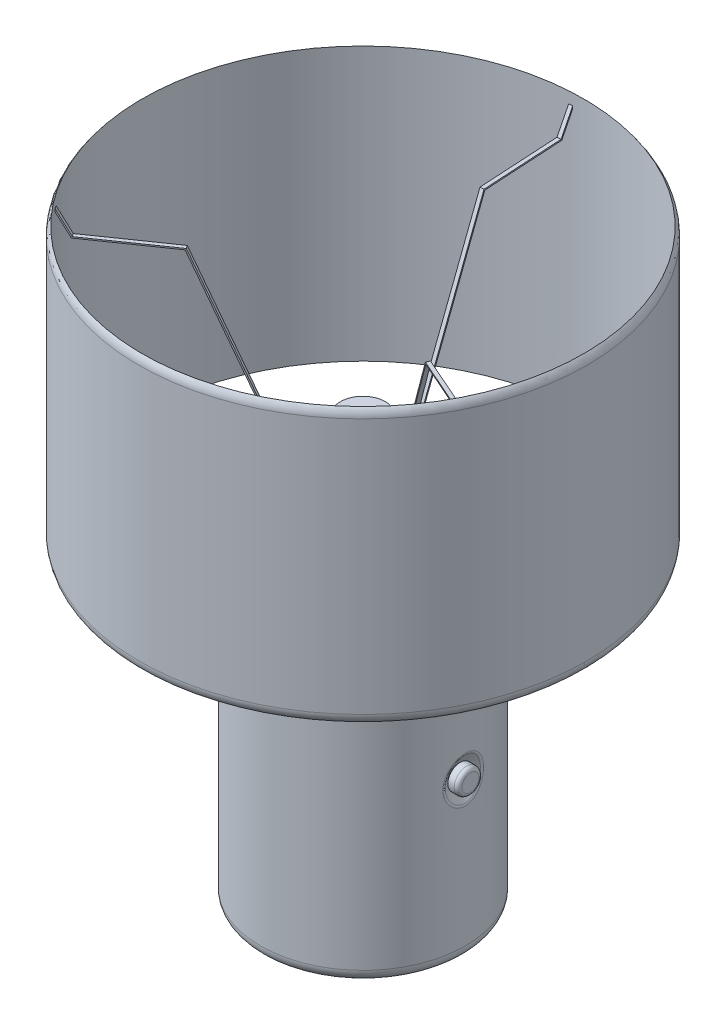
ISO-10303-21;
HEADER;
FILE_DESCRIPTION(('STEP AP214'),'2;1');
FILE_NAME('part.step','',(''),(''),'','','');
FILE_SCHEMA(('AUTOMOTIVE_DESIGN { 1 0 10303 214 1 1 1 1 }'));
ENDSEC;
DATA;
#1=APPLICATION_CONTEXT('core data for automotive mechanical design processes');
#2=APPLICATION_PROTOCOL_DEFINITION('international standard','automotive_design',2000,#1);
#3=PRODUCT_CONTEXT('',#1,'mechanical');
#4=PRODUCT('Part','Part','',(#3));
#5=PRODUCT_RELATED_PRODUCT_CATEGORY('part','',(#4));
#6=PRODUCT_DEFINITION_FORMATION('','',#4);
#7=PRODUCT_DEFINITION_CONTEXT('part definition',#1,'design');
#8=PRODUCT_DEFINITION('design','',#6,#7);
#9=PRODUCT_DEFINITION_SHAPE('','',#8);
#10=(LENGTH_UNIT() NAMED_UNIT(*) SI_UNIT(.MILLI.,.METRE.));
#11=(NAMED_UNIT(*) PLANE_ANGLE_UNIT() SI_UNIT($,.RADIAN.));
#12=(NAMED_UNIT(*) SI_UNIT($,.STERADIAN.) SOLID_ANGLE_UNIT());
#13=UNCERTAINTY_MEASURE_WITH_UNIT(LENGTH_MEASURE(1.E-05),#10,'distance_accuracy_value','');
#14=(GEOMETRIC_REPRESENTATION_CONTEXT(3) GLOBAL_UNCERTAINTY_ASSIGNED_CONTEXT((#13)) GLOBAL_UNIT_ASSIGNED_CONTEXT((#10,
#11,#12)) REPRESENTATION_CONTEXT('',''));
#15=CARTESIAN_POINT('',(0.,0.,0.));
#16=DIRECTION('',(0.,0.,1.));
#17=DIRECTION('',(1.,0.,0.));
#18=AXIS2_PLACEMENT_3D('',#15,#16,#17);
#19=CARTESIAN_POINT('',(-3.13503691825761,101.894600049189,249.914010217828));
#20=DIRECTION('',(0.998355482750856,0.,-0.0573265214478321));
#21=DIRECTION('',(-0.0573265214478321,0.,-0.998355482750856));
#22=AXIS2_PLACEMENT_3D('',#19,#20,#21);
#23=PLANE('',#22);
#24=DIRECTION('',(-0.0221946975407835,0.922011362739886,-0.386526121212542));
#25=VECTOR('',#24,1.);
#26=CARTESIAN_POINT('',(-8.80304780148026,292.119233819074,151.204205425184));
#27=LINE('',#26,#25);
#28=CARTESIAN_POINT('',(-4.85483256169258,128.102611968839,219.963345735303));
#29=VERTEX_POINT('',#28);
#30=CARTESIAN_POINT('',(-8.80304780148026,292.119233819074,151.204205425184));
#31=VERTEX_POINT('',#30);
#32=EDGE_CURVE('P0_E337',#29,#31,#27,.T.);
#33=ORIENTED_EDGE('',*,*,#32,.F.);
#34=DIRECTION('',(0.,-1.,0.));
#35=VECTOR('',#34,1.);
#36=CARTESIAN_POINT('',(-4.85483256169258,134.602611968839,219.963345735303));
#37=LINE('',#36,#35);
#38=CARTESIAN_POINT('',(-4.85483256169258,127.102611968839,219.963345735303));
#39=VERTEX_POINT('',#38);
#40=EDGE_CURVE('P0_E31',#29,#39,#37,.T.);
#41=ORIENTED_EDGE('',*,*,#40,.T.);
#42=DIRECTION('',(0.0573265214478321,0.,0.998355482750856));
#43=VECTOR('',#42,1.);
#44=CARTESIAN_POINT('',(-4.8929360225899,127.102611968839,219.299764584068));
#45=LINE('',#44,#43);
#46=CARTESIAN_POINT('',(-4.8929360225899,127.102611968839,219.299764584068));
#47=VERTEX_POINT('',#46);
#48=EDGE_CURVE('P0_E342',#47,#39,#45,.T.);
#49=ORIENTED_EDGE('',*,*,#48,.F.);
#50=DIRECTION('',(0.0221946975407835,-0.922011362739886,0.386526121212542));
#51=VECTOR('',#50,1.);
#52=CARTESIAN_POINT('',(-8.84115126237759,291.119233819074,150.540624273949));
#53=LINE('',#52,#51);
#54=CARTESIAN_POINT('',(-8.84115126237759,291.119233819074,150.540624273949));
#55=VERTEX_POINT('',#54);
#56=EDGE_CURVE('P0_E345',#55,#47,#53,.T.);
#57=ORIENTED_EDGE('',*,*,#56,.F.);
#58=DIRECTION('',(0.0573265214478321,0.,0.998355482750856));
#59=VECTOR('',#58,1.);
#60=CARTESIAN_POINT('',(-12.5021793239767,291.119233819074,86.7829193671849));
#61=LINE('',#60,#59);
#62=CARTESIAN_POINT('',(-12.5021793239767,291.119233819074,86.7829193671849));
#63=VERTEX_POINT('',#62);
#64=EDGE_CURVE('P0_E347',#63,#55,#61,.T.);
#65=ORIENTED_EDGE('',*,*,#64,.F.);
#66=DIRECTION('',(0.0277377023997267,-0.875148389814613,0.483058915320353));
#67=VECTOR('',#66,1.);
#68=CARTESIAN_POINT('',(-13.136585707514,311.135301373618,75.7345760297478));
#69=LINE('',#68,#67);
#70=CARTESIAN_POINT('',(-13.0234879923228,307.566971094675,77.7042005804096));
#71=VERTEX_POINT('',#70);
#72=EDGE_CURVE('P0_E349',#71,#63,#69,.T.);
#73=ORIENTED_EDGE('',*,*,#72,.F.);
#74=DIRECTION('',(0.,1.,0.));
#75=VECTOR('',#74,1.);
#76=CARTESIAN_POINT('',(-13.0234879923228,71.8946000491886,77.7042005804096));
#77=LINE('',#76,#75);
#78=CARTESIAN_POINT('',(-13.0234879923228,309.633707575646,77.7042005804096));
#79=VERTEX_POINT('',#78);
#80=EDGE_CURVE('P0_E300',#79,#71,#77,.F.);
#81=ORIENTED_EDGE('',*,*,#80,.F.);
#82=DIRECTION('',(-0.0277377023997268,0.875148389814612,-0.483058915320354));
#83=VECTOR('',#82,1.);
#84=CARTESIAN_POINT('',(-13.0864164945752,311.619155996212,76.6082852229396));
#85=LINE('',#84,#83);
#86=CARTESIAN_POINT('',(-12.4683692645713,292.119233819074,87.3717298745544));
#87=VERTEX_POINT('',#86);
#88=EDGE_CURVE('P0_E331',#87,#79,#85,.T.);
#89=ORIENTED_EDGE('',*,*,#88,.F.);
#90=DIRECTION('',(-0.0573265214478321,0.,-0.998355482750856));
#91=VECTOR('',#90,1.);
#92=CARTESIAN_POINT('',(-12.4683692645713,292.119233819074,87.3717298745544));
#93=LINE('',#92,#91);
#94=EDGE_CURVE('P0_E335',#31,#87,#93,.T.);
#95=ORIENTED_EDGE('',*,*,#94,.F.);
#96=EDGE_LOOP('',(#33,#41,#49,#57,#65,#73,#81,#89,#95));
#97=FACE_BOUND('',#96,.T.);
#98=ADVANCED_FACE('P0_F16',(#97),#23,.T.);
#99=CARTESIAN_POINT('',(-6.13010336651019,101.894600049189,250.085989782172));
#100=DIRECTION('',(0.998355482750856,0.,-0.0573265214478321));
#101=DIRECTION('',(-0.0573265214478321,0.,-0.998355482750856));
#102=AXIS2_PLACEMENT_3D('',#99,#100,#101);
#103=PLANE('',#102);
#104=DIRECTION('',(0.,-1.,0.));
#105=VECTOR('',#104,1.);
#106=CARTESIAN_POINT('',(-7.84989900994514,134.602611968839,220.135325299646));
#107=LINE('',#106,#105);
#108=CARTESIAN_POINT('',(-7.84989900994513,128.102611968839,220.135325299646));
#109=VERTEX_POINT('',#108);
#110=CARTESIAN_POINT('',(-7.84989900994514,127.102611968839,220.135325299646));
#111=VERTEX_POINT('',#110);
#112=EDGE_CURVE('P0_E508',#109,#111,#107,.T.);
#113=ORIENTED_EDGE('',*,*,#112,.F.);
#114=DIRECTION('',(-0.0221946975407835,0.922011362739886,-0.386526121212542));
#115=VECTOR('',#114,1.);
#116=CARTESIAN_POINT('',(-11.7981142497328,292.119233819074,151.376184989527));
#117=LINE('',#116,#115);
#118=CARTESIAN_POINT('',(-11.7981142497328,292.119233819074,151.376184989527));
#119=VERTEX_POINT('',#118);
#120=EDGE_CURVE('P0_E356',#109,#119,#117,.T.);
#121=ORIENTED_EDGE('',*,*,#120,.T.);
#122=DIRECTION('',(-0.0573265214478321,0.,-0.998355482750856));
#123=VECTOR('',#122,1.);
#124=CARTESIAN_POINT('',(-15.4634357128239,292.119233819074,87.543709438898));
#125=LINE('',#124,#123);
#126=CARTESIAN_POINT('',(-15.4634357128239,292.119233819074,87.543709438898));
#127=VERTEX_POINT('',#126);
#128=EDGE_CURVE('P0_E354',#119,#127,#125,.T.);
#129=ORIENTED_EDGE('',*,*,#128,.T.);
#130=DIRECTION('',(-0.0277377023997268,0.875148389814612,-0.483058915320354));
#131=VECTOR('',#130,1.);
#132=CARTESIAN_POINT('',(-16.0814829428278,311.619155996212,76.7802647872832));
#133=LINE('',#132,#131);
#134=CARTESIAN_POINT('',(-16.0185544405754,309.633707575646,77.8761801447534));
#135=VERTEX_POINT('',#134);
#136=EDGE_CURVE('P0_E330',#127,#135,#133,.T.);
#137=ORIENTED_EDGE('',*,*,#136,.T.);
#138=DIRECTION('',(0.,1.,0.));
#139=VECTOR('',#138,1.);
#140=CARTESIAN_POINT('',(-16.0185544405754,71.8946000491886,77.8761801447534));
#141=LINE('',#140,#139);
#142=CARTESIAN_POINT('',(-16.0185544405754,307.566971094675,77.8761801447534));
#143=VERTEX_POINT('',#142);
#144=EDGE_CURVE('P0_E293',#135,#143,#141,.F.);
#145=ORIENTED_EDGE('',*,*,#144,.T.);
#146=DIRECTION('',(0.0277377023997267,-0.875148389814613,0.483058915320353));
#147=VECTOR('',#146,1.);
#148=CARTESIAN_POINT('',(-16.1316521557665,311.135301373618,75.9065555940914));
#149=LINE('',#148,#147);
#150=CARTESIAN_POINT('',(-15.4972457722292,291.119233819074,86.9548989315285));
#151=VERTEX_POINT('',#150);
#152=EDGE_CURVE('P0_E334',#143,#151,#149,.T.);
#153=ORIENTED_EDGE('',*,*,#152,.T.);
#154=DIRECTION('',(0.0573265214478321,0.,0.998355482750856));
#155=VECTOR('',#154,1.);
#156=CARTESIAN_POINT('',(-15.4972457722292,291.119233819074,86.9548989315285));
#157=LINE('',#156,#155);
#158=CARTESIAN_POINT('',(-11.8362177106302,291.119233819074,150.712603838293));
#159=VERTEX_POINT('',#158);
#160=EDGE_CURVE('P0_E366',#151,#159,#157,.T.);
#161=ORIENTED_EDGE('',*,*,#160,.T.);
#162=DIRECTION('',(0.0221946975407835,-0.922011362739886,0.386526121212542));
#163=VECTOR('',#162,1.);
#164=CARTESIAN_POINT('',(-11.8362177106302,291.119233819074,150.712603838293));
#165=LINE('',#164,#163);
#166=CARTESIAN_POINT('',(-7.88800247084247,127.102611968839,219.471744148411));
#167=VERTEX_POINT('',#166);
#168=EDGE_CURVE('P0_E364',#159,#167,#165,.T.);
#169=ORIENTED_EDGE('',*,*,#168,.T.);
#170=DIRECTION('',(0.0573265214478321,0.,0.998355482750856));
#171=VECTOR('',#170,1.);
#172=CARTESIAN_POINT('',(-7.88800247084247,127.102611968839,219.471744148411));
#173=LINE('',#172,#171);
#174=EDGE_CURVE('P0_E361',#167,#111,#173,.T.);
#175=ORIENTED_EDGE('',*,*,#174,.T.);
#176=EDGE_LOOP('',(#113,#121,#129,#137,#145,#153,#161,#169,#175));
#177=FACE_BOUND('',#176,.T.);
#178=ADVANCED_FACE('P0_F558',(#177),#103,.F.);
#179=CARTESIAN_POINT('',(-7.88800247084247,127.102611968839,219.471744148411));
#180=DIRECTION('',(0.,1.,0.));
#181=DIRECTION('',(0.0573265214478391,0.,0.998355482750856));
#182=AXIS2_PLACEMENT_3D('',#179,#180,#181);
#183=PLANE('',#182);
#184=CARTESIAN_POINT('',(-4.63257014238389,127.102611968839,250.));
#185=DIRECTION('',(0.,1.,0.));
#186=DIRECTION('',(0.0573265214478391,0.,0.998355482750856));
#187=AXIS2_PLACEMENT_3D('',#184,#185,#186);
#188=CIRCLE('',#187,30.0374765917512);
#189=CARTESIAN_POINT('',(-28.4153415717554,127.102611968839,268.347473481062));
#190=VERTEX_POINT('',#189);
#191=CARTESIAN_POINT('',(-30.1268961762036,127.102611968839,265.883618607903));
#192=VERTEX_POINT('',#191);
#193=EDGE_CURVE('P0_E514',#190,#192,#188,.F.);
#194=ORIENTED_EDGE('',*,*,#193,.F.);
#195=DIRECTION('',(0.821284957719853,0.,-0.570518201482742));
#196=VECTOR('',#195,1.);
#197=CARTESIAN_POINT('',(-28.9612285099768,127.102611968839,268.726682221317));
#198=LINE('',#197,#196);
#199=CARTESIAN_POINT('',(-28.9612285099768,127.102611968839,268.726682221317));
#200=VERTEX_POINT('',#199);
#201=EDGE_CURVE('P0_E430',#200,#190,#198,.T.);
#202=ORIENTED_EDGE('',*,*,#201,.F.);
#203=DIRECTION('',(-0.570518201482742,0.,-0.821284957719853));
#204=VECTOR('',#203,1.);
#205=CARTESIAN_POINT('',(-28.9612285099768,127.102611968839,268.726682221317));
#206=LINE('',#205,#204);
#207=CARTESIAN_POINT('',(-30.672783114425,127.102611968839,266.262827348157));
#208=VERTEX_POINT('',#207);
#209=EDGE_CURVE('P0_E389',#200,#208,#206,.T.);
#210=ORIENTED_EDGE('',*,*,#209,.T.);
#211=DIRECTION('',(0.821284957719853,0.,-0.570518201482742));
#212=VECTOR('',#211,1.);
#213=CARTESIAN_POINT('',(-30.672783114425,127.102611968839,266.262827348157));
#214=LINE('',#213,#212);
#215=EDGE_CURVE('P0_E410',#208,#192,#214,.T.);
#216=ORIENTED_EDGE('',*,*,#215,.T.);
#217=EDGE_LOOP('',(#194,#202,#210,#216));
#218=FACE_BOUND('',#217,.T.);
#219=ADVANCED_FACE('P0_F564',(#218),#183,.F.);
#220=EDGE_CURVE('P0_E38',#111,#39,#188,.F.);
#221=ORIENTED_EDGE('',*,*,#220,.F.);
#222=ORIENTED_EDGE('',*,*,#174,.F.);
#223=DIRECTION('',(0.998355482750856,0.,-0.0573265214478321));
#224=VECTOR('',#223,1.);
#225=CARTESIAN_POINT('',(-7.88800247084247,127.102611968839,219.471744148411));
#226=LINE('',#225,#224);
#227=EDGE_CURVE('P0_E321',#167,#47,#226,.T.);
#228=ORIENTED_EDGE('',*,*,#227,.T.);
#229=ORIENTED_EDGE('',*,*,#48,.T.);
#230=EDGE_LOOP('',(#221,#222,#228,#229));
#231=FACE_BOUND('',#230,.T.);
#232=ADVANCED_FACE('P0_F701',(#231),#183,.F.);
#233=CARTESIAN_POINT('',(-3.77679284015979,101.894600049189,251.23192743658));
#234=DIRECTION('',(-0.570518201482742,0.,-0.821284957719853));
#235=DIRECTION('',(-0.821284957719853,0.,0.570518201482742));
#236=AXIS2_PLACEMENT_3D('',#233,#234,#235);
#237=PLANE('',#236);
#238=DIRECTION('',(0.,-1.,0.));
#239=VECTOR('',#238,1.);
#240=CARTESIAN_POINT('',(-28.4153415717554,134.602611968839,268.347473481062));
#241=LINE('',#240,#239);
#242=CARTESIAN_POINT('',(-28.4153415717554,128.102611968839,268.347473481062));
#243=VERTEX_POINT('',#242);
#244=EDGE_CURVE('P0_E515',#243,#190,#241,.T.);
#245=ORIENTED_EDGE('',*,*,#244,.F.);
#246=DIRECTION('',(-0.317970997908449,0.922011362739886,0.220883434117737));
#247=VECTOR('',#246,1.);
#248=CARTESIAN_POINT('',(-84.9792094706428,292.119233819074,307.640432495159));
#249=LINE('',#248,#247);
#250=CARTESIAN_POINT('',(-84.9792094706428,292.119233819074,307.640432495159));
#251=VERTEX_POINT('',#250);
#252=EDGE_CURVE('P0_E425',#243,#251,#249,.T.);
#253=ORIENTED_EDGE('',*,*,#252,.T.);
#254=DIRECTION('',(-0.821284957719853,0.,0.570518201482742));
#255=VECTOR('',#254,1.);
#256=CARTESIAN_POINT('',(-137.490216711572,292.119233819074,344.118009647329));
#257=LINE('',#256,#255);
#258=CARTESIAN_POINT('',(-137.490216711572,292.119233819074,344.118009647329));
#259=VERTEX_POINT('',#258);
#260=EDGE_CURVE('P0_E423',#251,#259,#257,.T.);
#261=ORIENTED_EDGE('',*,*,#260,.T.);
#262=DIRECTION('',(-0.397382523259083,0.875148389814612,0.276047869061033));
#263=VECTOR('',#262,1.);
#264=CARTESIAN_POINT('',(-146.344633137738,311.619155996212,350.268865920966));
#265=LINE('',#264,#263);
#266=CARTESIAN_POINT('',(-145.443091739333,309.633707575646,349.642596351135));
#267=VERTEX_POINT('',#266);
#268=EDGE_CURVE('P0_E398',#259,#267,#265,.T.);
#269=ORIENTED_EDGE('',*,*,#268,.T.);
#270=DIRECTION('',(0.,1.,0.));
#271=VECTOR('',#270,1.);
#272=CARTESIAN_POINT('',(-145.443091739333,71.8946000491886,349.642596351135));
#273=LINE('',#272,#271);
#274=CARTESIAN_POINT('',(-145.443091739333,307.566971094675,349.642596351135));
#275=VERTEX_POINT('',#274);
#276=EDGE_CURVE('P0_E277',#267,#275,#273,.F.);
#277=ORIENTED_EDGE('',*,*,#276,.T.);
#278=DIRECTION('',(0.397382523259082,-0.875148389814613,-0.276047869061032));
#279=VECTOR('',#278,1.);
#280=CARTESIAN_POINT('',(-147.063379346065,311.135301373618,350.768154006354));
#281=LINE('',#280,#279);
#282=CARTESIAN_POINT('',(-137.974594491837,291.119233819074,344.454490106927));
#283=VERTEX_POINT('',#282);
#284=EDGE_CURVE('P0_E402',#275,#283,#281,.T.);
#285=ORIENTED_EDGE('',*,*,#284,.T.);
#286=DIRECTION('',(0.821284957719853,0.,-0.570518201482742));
#287=VECTOR('',#286,1.);
#288=CARTESIAN_POINT('',(-137.974594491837,291.119233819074,344.454490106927));
#289=LINE('',#288,#287);
#290=CARTESIAN_POINT('',(-85.5250964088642,291.119233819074,308.019641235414));
#291=VERTEX_POINT('',#290);
#292=EDGE_CURVE('P0_E436',#283,#291,#289,.T.);
#293=ORIENTED_EDGE('',*,*,#292,.T.);
#294=DIRECTION('',(0.31797099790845,-0.922011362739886,-0.220883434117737));
#295=VECTOR('',#294,1.);
#296=CARTESIAN_POINT('',(-85.5250964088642,291.119233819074,308.019641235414));
#297=LINE('',#296,#295);
#298=EDGE_CURVE('P0_E434',#291,#200,#297,.T.);
#299=ORIENTED_EDGE('',*,*,#298,.T.);
#300=ORIENTED_EDGE('',*,*,#201,.T.);
#301=EDGE_LOOP('',(#245,#253,#261,#269,#277,#285,#293,#299,#300));
#302=FACE_BOUND('',#301,.T.);
#303=ADVANCED_FACE('P0_F640',(#302),#237,.F.);
#304=CARTESIAN_POINT('',(-5.23581854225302,101.894600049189,251.373350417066));
#305=DIRECTION('',(-0.40216559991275,0.,0.915566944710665));
#306=DIRECTION('',(0.915566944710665,0.,0.40216559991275));
#307=AXIS2_PLACEMENT_3D('',#304,#305,#306);
#308=PLANE('',#307);
#309=DIRECTION('',(0.354473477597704,0.922011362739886,0.155703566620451));
#310=VECTOR('',#309,1.);
#311=CARTESIAN_POINT('',(85.2884846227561,292.119233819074,291.136429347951));
#312=LINE('',#311,#310);
#313=CARTESIAN_POINT('',(22.2311897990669,128.102611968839,263.438318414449));
#314=VERTEX_POINT('',#313);
#315=CARTESIAN_POINT('',(85.2884846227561,292.119233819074,291.136429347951));
#316=VERTEX_POINT('',#315);
#317=EDGE_CURVE('P0_E458',#314,#316,#312,.T.);
#318=ORIENTED_EDGE('',*,*,#317,.F.);
#319=DIRECTION('',(0.,-1.,0.));
#320=VECTOR('',#319,1.);
#321=CARTESIAN_POINT('',(22.2311897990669,134.602611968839,263.438318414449));
#322=LINE('',#321,#320);
#323=CARTESIAN_POINT('',(22.2311897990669,127.102611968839,263.438318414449));
#324=VERTEX_POINT('',#323);
#325=EDGE_CURVE('P0_E271',#314,#324,#322,.T.);
#326=ORIENTED_EDGE('',*,*,#325,.T.);
#327=DIRECTION('',(-0.915566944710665,0.,-0.40216559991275));
#328=VECTOR('',#327,1.);
#329=CARTESIAN_POINT('',(22.8397435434,127.102611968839,263.705627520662));
#330=LINE('',#329,#328);
#331=CARTESIAN_POINT('',(22.8397435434,127.102611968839,263.705627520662));
#332=VERTEX_POINT('',#331);
#333=EDGE_CURVE('P0_E463',#332,#324,#330,.T.);
#334=ORIENTED_EDGE('',*,*,#333,.F.);
#335=DIRECTION('',(-0.354473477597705,-0.922011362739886,-0.155703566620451));
#336=VECTOR('',#335,1.);
#337=CARTESIAN_POINT('',(85.8970383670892,291.119233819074,291.403738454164));
#338=LINE('',#337,#336);
#339=CARTESIAN_POINT('',(85.8970383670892,291.119233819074,291.403738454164));
#340=VERTEX_POINT('',#339);
#341=EDGE_CURVE('P0_E467',#340,#332,#338,.T.);
#342=ORIENTED_EDGE('',*,*,#341,.F.);
#343=DIRECTION('',(-0.915566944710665,0.,-0.40216559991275));
#344=VECTOR('',#343,1.);
#345=CARTESIAN_POINT('',(144.367641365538,291.119233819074,317.087130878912));
#346=LINE('',#345,#344);
#347=CARTESIAN_POINT('',(144.367641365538,291.119233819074,317.087130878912));
#348=VERTEX_POINT('',#347);
#349=EDGE_CURVE('P0_E469',#348,#340,#346,.T.);
#350=ORIENTED_EDGE('',*,*,#349,.F.);
#351=DIRECTION('',(-0.443001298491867,-0.875148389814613,-0.194589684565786));
#352=VECTOR('',#351,1.);
#353=CARTESIAN_POINT('',(154.499801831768,311.135301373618,321.537713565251));
#354=LINE('',#353,#352);
#355=CARTESIAN_POINT('',(152.693508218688,307.566971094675,320.744293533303));
#356=VERTEX_POINT('',#355);
#357=EDGE_CURVE('P0_E471',#356,#348,#354,.T.);
#358=ORIENTED_EDGE('',*,*,#357,.F.);
#359=DIRECTION('',(0.,1.,0.));
#360=VECTOR('',#359,1.);
#361=CARTESIAN_POINT('',(152.693508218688,71.8946000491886,320.744293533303));
#362=LINE('',#361,#360);
#363=CARTESIAN_POINT('',(152.693508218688,309.633707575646,320.744293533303));
#364=VERTEX_POINT('',#363);
#365=EDGE_CURVE('P0_E285',#364,#356,#362,.F.);
#366=ORIENTED_EDGE('',*,*,#365,.F.);
#367=DIRECTION('',(0.443001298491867,0.875148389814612,0.194589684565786));
#368=VECTOR('',#367,1.);
#369=CARTESIAN_POINT('',(153.698544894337,311.619155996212,321.185758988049));
#370=LINE('',#369,#368);
#371=CARTESIAN_POINT('',(143.827657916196,292.119233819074,316.849941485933));
#372=VERTEX_POINT('',#371);
#373=EDGE_CURVE('P0_E452',#372,#364,#370,.T.);
#374=ORIENTED_EDGE('',*,*,#373,.F.);
#375=DIRECTION('',(0.915566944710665,0.,0.40216559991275));
#376=VECTOR('',#375,1.);
#377=CARTESIAN_POINT('',(143.827657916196,292.119233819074,316.849941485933));
#378=LINE('',#377,#376);
#379=EDGE_CURVE('P0_E456',#316,#372,#378,.T.);
#380=ORIENTED_EDGE('',*,*,#379,.F.);
#381=EDGE_LOOP('',(#318,#326,#334,#342,#350,#358,#366,#374,#380));
#382=FACE_BOUND('',#381,.T.);
#383=ADVANCED_FACE('P0_F771',(#382),#308,.T.);
#384=CARTESIAN_POINT('',(-5.48834744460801,101.894600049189,248.76807256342));
#385=DIRECTION('',(-0.570518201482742,0.,-0.821284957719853));
#386=DIRECTION('',(-0.821284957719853,0.,0.570518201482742));
#387=AXIS2_PLACEMENT_3D('',#384,#385,#386);
#388=PLANE('',#387);
#389=DIRECTION('',(-0.317970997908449,0.922011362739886,0.220883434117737));
#390=VECTOR('',#389,1.);
#391=CARTESIAN_POINT('',(-86.690764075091,292.119233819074,305.176577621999));
#392=LINE('',#391,#390);
#393=CARTESIAN_POINT('',(-30.1268961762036,128.102611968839,265.883618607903));
#394=VERTEX_POINT('',#393);
#395=CARTESIAN_POINT('',(-86.690764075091,292.119233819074,305.176577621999));
#396=VERTEX_POINT('',#395);
#397=EDGE_CURVE('P0_E405',#394,#396,#392,.T.);
#398=ORIENTED_EDGE('',*,*,#397,.F.);
#399=DIRECTION('',(0.,-1.,0.));
#400=VECTOR('',#399,1.);
#401=CARTESIAN_POINT('',(-30.1268961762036,134.602611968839,265.883618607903));
#402=LINE('',#401,#400);
#403=EDGE_CURVE('P0_E518',#394,#192,#402,.T.);
#404=ORIENTED_EDGE('',*,*,#403,.T.);
#405=ORIENTED_EDGE('',*,*,#215,.F.);
#406=DIRECTION('',(0.31797099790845,-0.922011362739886,-0.220883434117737));
#407=VECTOR('',#406,1.);
#408=CARTESIAN_POINT('',(-87.2366510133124,291.119233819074,305.555786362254));
#409=LINE('',#408,#407);
#410=CARTESIAN_POINT('',(-87.2366510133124,291.119233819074,305.555786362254));
#411=VERTEX_POINT('',#410);
#412=EDGE_CURVE('P0_E414',#411,#208,#409,.T.);
#413=ORIENTED_EDGE('',*,*,#412,.F.);
#414=DIRECTION('',(0.821284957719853,0.,-0.570518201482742));
#415=VECTOR('',#414,1.);
#416=CARTESIAN_POINT('',(-139.686149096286,291.119233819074,341.990635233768));
#417=LINE('',#416,#415);
#418=CARTESIAN_POINT('',(-139.686149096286,291.119233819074,341.990635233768));
#419=VERTEX_POINT('',#418);
#420=EDGE_CURVE('P0_E416',#419,#411,#417,.T.);
#421=ORIENTED_EDGE('',*,*,#420,.F.);
#422=DIRECTION('',(0.397382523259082,-0.875148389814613,-0.276047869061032));
#423=VECTOR('',#422,1.);
#424=CARTESIAN_POINT('',(-148.774933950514,311.135301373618,348.304299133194));
#425=LINE('',#424,#423);
#426=CARTESIAN_POINT('',(-147.154646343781,307.566971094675,347.178741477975));
#427=VERTEX_POINT('',#426);
#428=EDGE_CURVE('P0_E418',#427,#419,#425,.T.);
#429=ORIENTED_EDGE('',*,*,#428,.F.);
#430=DIRECTION('',(0.,1.,0.));
#431=VECTOR('',#430,1.);
#432=CARTESIAN_POINT('',(-147.154646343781,71.8946000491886,347.178741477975));
#433=LINE('',#432,#431);
#434=CARTESIAN_POINT('',(-147.154646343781,309.633707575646,347.178741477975));
#435=VERTEX_POINT('',#434);
#436=EDGE_CURVE('P0_E351',#435,#427,#433,.F.);
#437=ORIENTED_EDGE('',*,*,#436,.F.);
#438=DIRECTION('',(-0.397382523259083,0.875148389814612,0.276047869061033));
#439=VECTOR('',#438,1.);
#440=CARTESIAN_POINT('',(-148.056187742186,311.619155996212,347.805011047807));
#441=LINE('',#440,#439);
#442=CARTESIAN_POINT('',(-139.201771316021,292.119233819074,341.654154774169));
#443=VERTEX_POINT('',#442);
#444=EDGE_CURVE('P0_E399',#443,#435,#441,.T.);
#445=ORIENTED_EDGE('',*,*,#444,.F.);
#446=DIRECTION('',(-0.821284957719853,0.,0.570518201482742));
#447=VECTOR('',#446,1.);
#448=CARTESIAN_POINT('',(-139.201771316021,292.119233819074,341.654154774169));
#449=LINE('',#448,#447);
#450=EDGE_CURVE('P0_E403',#396,#443,#449,.T.);
#451=ORIENTED_EDGE('',*,*,#450,.F.);
#452=EDGE_LOOP('',(#398,#404,#405,#413,#421,#429,#437,#445,#451));
#453=FACE_BOUND('',#452,.T.);
#454=ADVANCED_FACE('P0_F643',(#453),#388,.T.);
#455=CARTESIAN_POINT('',(-4.02932174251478,101.894600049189,248.626649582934));
#456=DIRECTION('',(-0.40216559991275,0.,0.915566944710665));
#457=DIRECTION('',(0.915566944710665,0.,0.40216559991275));
#458=AXIS2_PLACEMENT_3D('',#455,#456,#457);
#459=PLANE('',#458);
#460=DIRECTION('',(0.,-1.,0.));
#461=VECTOR('',#460,1.);
#462=CARTESIAN_POINT('',(23.4376865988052,134.602611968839,260.691617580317));
#463=LINE('',#462,#461);
#464=CARTESIAN_POINT('',(23.4376865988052,128.102611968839,260.691617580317));
#465=VERTEX_POINT('',#464);
#466=CARTESIAN_POINT('',(23.4376865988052,127.102611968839,260.691617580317));
#467=VERTEX_POINT('',#466);
#468=EDGE_CURVE('P0_E265',#465,#467,#463,.T.);
#469=ORIENTED_EDGE('',*,*,#468,.F.);
#470=DIRECTION('',(0.354473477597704,0.922011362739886,0.155703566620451));
#471=VECTOR('',#470,1.);
#472=CARTESIAN_POINT('',(86.4949814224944,292.119233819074,288.389728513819));
#473=LINE('',#472,#471);
#474=CARTESIAN_POINT('',(86.4949814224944,292.119233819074,288.389728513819));
#475=VERTEX_POINT('',#474);
#476=EDGE_CURVE('P0_E251',#465,#475,#473,.T.);
#477=ORIENTED_EDGE('',*,*,#476,.T.);
#478=DIRECTION('',(0.915566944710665,0.,0.40216559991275));
#479=VECTOR('',#478,1.);
#480=CARTESIAN_POINT('',(145.034154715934,292.119233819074,314.103240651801));
#481=LINE('',#480,#479);
#482=CARTESIAN_POINT('',(145.034154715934,292.119233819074,314.103240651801));
#483=VERTEX_POINT('',#482);
#484=EDGE_CURVE('P0_E260',#475,#483,#481,.T.);
#485=ORIENTED_EDGE('',*,*,#484,.T.);
#486=DIRECTION('',(0.443001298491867,0.875148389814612,0.194589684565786));
#487=VECTOR('',#486,1.);
#488=CARTESIAN_POINT('',(154.905041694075,311.619155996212,318.439058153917));
#489=LINE('',#488,#487);
#490=CARTESIAN_POINT('',(153.900005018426,309.633707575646,317.997592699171));
#491=VERTEX_POINT('',#490);
#492=EDGE_CURVE('P0_E451',#483,#491,#489,.T.);
#493=ORIENTED_EDGE('',*,*,#492,.T.);
#494=DIRECTION('',(0.,1.,0.));
#495=VECTOR('',#494,1.);
#496=CARTESIAN_POINT('',(153.900005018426,71.8946000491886,317.997592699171));
#497=LINE('',#496,#495);
#498=CARTESIAN_POINT('',(153.900005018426,307.566971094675,317.997592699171));
#499=VERTEX_POINT('',#498);
#500=EDGE_CURVE('P0_E374',#491,#499,#497,.F.);
#501=ORIENTED_EDGE('',*,*,#500,.T.);
#502=DIRECTION('',(-0.443001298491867,-0.875148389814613,-0.194589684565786));
#503=VECTOR('',#502,1.);
#504=CARTESIAN_POINT('',(155.706298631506,311.135301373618,318.791012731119));
#505=LINE('',#504,#503);
#506=CARTESIAN_POINT('',(145.574138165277,291.119233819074,314.34043004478));
#507=VERTEX_POINT('',#506);
#508=EDGE_CURVE('P0_E455',#499,#507,#505,.T.);
#509=ORIENTED_EDGE('',*,*,#508,.T.);
#510=DIRECTION('',(-0.915566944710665,0.,-0.40216559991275));
#511=VECTOR('',#510,1.);
#512=CARTESIAN_POINT('',(145.574138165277,291.119233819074,314.34043004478));
#513=LINE('',#512,#511);
#514=CARTESIAN_POINT('',(87.1035351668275,291.119233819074,288.657037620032));
#515=VERTEX_POINT('',#514);
#516=EDGE_CURVE('P0_E483',#507,#515,#513,.T.);
#517=ORIENTED_EDGE('',*,*,#516,.T.);
#518=DIRECTION('',(-0.354473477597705,-0.922011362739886,-0.155703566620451));
#519=VECTOR('',#518,1.);
#520=CARTESIAN_POINT('',(87.1035351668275,291.119233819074,288.657037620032));
#521=LINE('',#520,#519);
#522=CARTESIAN_POINT('',(24.0462403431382,127.102611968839,260.95892668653));
#523=VERTEX_POINT('',#522);
#524=EDGE_CURVE('P0_E481',#515,#523,#521,.T.);
#525=ORIENTED_EDGE('',*,*,#524,.T.);
#526=DIRECTION('',(-0.915566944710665,0.,-0.40216559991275));
#527=VECTOR('',#526,1.);
#528=CARTESIAN_POINT('',(24.0462403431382,127.102611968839,260.95892668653));
#529=LINE('',#528,#527);
#530=EDGE_CURVE('P0_E268',#523,#467,#529,.T.);
#531=ORIENTED_EDGE('',*,*,#530,.T.);
#532=EDGE_LOOP('',(#469,#477,#485,#493,#501,#509,#517,#525,#531));
#533=FACE_BOUND('',#532,.T.);
#534=ADVANCED_FACE('P0_F266',(#533),#459,.F.);
#535=CARTESIAN_POINT('',(-4.63257014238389,71.8946000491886,250.));
#536=DIRECTION('',(0.,1.,0.));
#537=DIRECTION('',(0.0573265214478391,0.,0.998355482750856));
#538=AXIS2_PLACEMENT_3D('',#535,#536,#537);
#539=CYLINDRICAL_SURFACE('',#538,172.5);
#540=ORIENTED_EDGE('',*,*,#144,.F.);
#541=CARTESIAN_POINT('',(-4.63257014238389,-2.35543667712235,250.));
#542=DIRECTION('',(-0.0501692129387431,-0.483854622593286,-0.873709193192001));
#543=DIRECTION('',(-0.0277377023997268,0.875148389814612,-0.483058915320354));
#544=AXIS2_PLACEMENT_3D('',#541,#542,#543);
#545=ELLIPSE('',#544,356.512042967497,172.5);
#546=EDGE_CURVE('P0_E298',#79,#135,#545,.F.);
#547=ORIENTED_EDGE('',*,*,#546,.F.);
#548=ORIENTED_EDGE('',*,*,#80,.T.);
#549=CARTESIAN_POINT('',(-4.63257014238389,-4.4221731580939,250.));
#550=DIRECTION('',(0.0501692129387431,0.483854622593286,0.873709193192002));
#551=DIRECTION('',(-0.0277377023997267,0.875148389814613,-0.483058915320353));
#552=AXIS2_PLACEMENT_3D('',#549,#550,#551);
#553=ELLIPSE('',#552,356.512042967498,172.5);
#554=EDGE_CURVE('P0_E295',#143,#71,#553,.F.);
#555=ORIENTED_EDGE('',*,*,#554,.F.);
#556=EDGE_LOOP('',(#540,#547,#548,#555));
#557=FACE_BOUND('',#556,.T.);
#558=CARTESIAN_POINT('',(-4.63257014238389,105.280221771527,250.));
#559=DIRECTION('',(0.,1.,0.));
#560=DIRECTION('',(0.0573265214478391,0.,0.998355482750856));
#561=AXIS2_PLACEMENT_3D('',#558,#559,#560);
#562=CIRCLE('',#561,172.5);
#563=CARTESIAN_POINT('',(5.25625480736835,105.280221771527,422.216320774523));
#564=VERTEX_POINT('',#563);
#565=EDGE_CURVE('P0_E307',#564,#564,#562,.F.);
#566=ORIENTED_EDGE('',*,*,#565,.T.);
#567=EDGE_LOOP('',(#566));
#568=FACE_BOUND('',#567,.T.);
#569=CARTESIAN_POINT('',(-4.63257014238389,318.50897832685,250.));
#570=DIRECTION('',(0.,-1.,0.));
#571=DIRECTION('',(-0.0573265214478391,0.,-0.998355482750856));
#572=AXIS2_PLACEMENT_3D('',#569,#570,#571);
#573=CIRCLE('',#572,172.5);
#574=CARTESIAN_POINT('',(-14.5213950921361,318.50897832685,77.7836792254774));
#575=VERTEX_POINT('',#574);
#576=EDGE_CURVE('P0_E304',#575,#575,#573,.F.);
#577=ORIENTED_EDGE('',*,*,#576,.T.);
#578=EDGE_LOOP('',(#577));
#579=FACE_BOUND('',#578,.T.);
#580=CARTESIAN_POINT('',(-4.63257014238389,-2.3554366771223,250.));
#581=DIRECTION('',(0.801256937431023,-0.483854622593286,0.35195457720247));
#582=DIRECTION('',(0.443001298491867,0.875148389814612,0.194589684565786));
#583=AXIS2_PLACEMENT_3D('',#580,#581,#582);
#584=ELLIPSE('',#583,356.512042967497,172.5);
#585=EDGE_CURVE('P0_E290',#364,#491,#584,.F.);
#586=ORIENTED_EDGE('',*,*,#585,.F.);
#587=ORIENTED_EDGE('',*,*,#365,.T.);
#588=CARTESIAN_POINT('',(-4.63257014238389,-4.42217315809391,250.));
#589=DIRECTION('',(-0.801256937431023,0.483854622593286,-0.35195457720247));
#590=DIRECTION('',(0.443001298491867,0.875148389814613,0.194589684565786));
#591=AXIS2_PLACEMENT_3D('',#588,#589,#590);
#592=ELLIPSE('',#591,356.512042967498,172.5);
#593=EDGE_CURVE('P0_E287',#499,#356,#592,.F.);
#594=ORIENTED_EDGE('',*,*,#593,.F.);
#595=ORIENTED_EDGE('',*,*,#500,.F.);
#596=EDGE_LOOP('',(#586,#587,#594,#595));
#597=FACE_BOUND('',#596,.T.);
#598=ORIENTED_EDGE('',*,*,#276,.F.);
#599=CARTESIAN_POINT('',(-4.63257014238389,-2.35543667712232,250.));
#600=DIRECTION('',(-0.718746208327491,-0.483854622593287,0.49928808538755));
#601=DIRECTION('',(-0.397382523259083,0.875148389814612,0.276047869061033));
#602=AXIS2_PLACEMENT_3D('',#599,#600,#601);
#603=ELLIPSE('',#602,356.512042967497,172.5);
#604=EDGE_CURVE('P0_E283',#435,#267,#603,.F.);
#605=ORIENTED_EDGE('',*,*,#604,.F.);
#606=ORIENTED_EDGE('',*,*,#436,.T.);
#607=CARTESIAN_POINT('',(-4.63257014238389,-4.42217315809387,250.));
#608=DIRECTION('',(0.718746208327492,0.483854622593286,-0.49928808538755));
#609=DIRECTION('',(-0.397382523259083,0.875148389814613,0.276047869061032));
#610=AXIS2_PLACEMENT_3D('',#607,#608,#609);
#611=ELLIPSE('',#610,356.512042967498,172.5);
#612=EDGE_CURVE('P0_E278',#275,#427,#611,.F.);
#613=ORIENTED_EDGE('',*,*,#612,.F.);
#614=EDGE_LOOP('',(#598,#605,#606,#613));
#615=FACE_BOUND('',#614,.T.);
#616=ADVANCED_FACE('P0_F679',(#557,#568,#579,#597,#615),#539,.F.);
#617=CARTESIAN_POINT('',(-4.63257014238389,321.894600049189,250.));
#618=DIRECTION('',(0.,-1.,0.));
#619=DIRECTION('',(-0.0573265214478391,0.,-0.998355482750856));
#620=AXIS2_PLACEMENT_3D('',#617,#618,#619);
#621=CYLINDRICAL_SURFACE('',#620,175.);
#622=CARTESIAN_POINT('',(-4.63257014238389,111.894600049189,250.));
#623=DIRECTION('',(0.,1.,0.));
#624=DIRECTION('',(0.0573265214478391,0.,0.998355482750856));
#625=AXIS2_PLACEMENT_3D('',#622,#623,#624);
#626=CIRCLE('',#625,175.);
#627=CARTESIAN_POINT('',(5.39957111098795,111.894600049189,424.7122094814));
#628=VERTEX_POINT('',#627);
#629=EDGE_CURVE('P0_E303',#628,#628,#626,.T.);
#630=ORIENTED_EDGE('',*,*,#629,.T.);
#631=EDGE_LOOP('',(#630));
#632=FACE_BOUND('',#631,.T.);
#633=CARTESIAN_POINT('',(-4.63257014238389,311.894600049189,250.));
#634=DIRECTION('',(0.,1.,0.));
#635=DIRECTION('',(0.0573265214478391,0.,0.998355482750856));
#636=AXIS2_PLACEMENT_3D('',#633,#634,#635);
#637=CIRCLE('',#636,175.);
#638=CARTESIAN_POINT('',(5.39957111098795,311.894600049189,424.7122094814));
#639=VERTEX_POINT('',#638);
#640=EDGE_CURVE('P0_E311',#639,#639,#637,.F.);
#641=ORIENTED_EDGE('',*,*,#640,.T.);
#642=EDGE_LOOP('',(#641));
#643=FACE_BOUND('',#642,.T.);
#644=ADVANCED_FACE('P0_F746',(#632,#643),#621,.T.);
#645=CARTESIAN_POINT('',(-4.63257014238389,111.894600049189,250.));
#646=DIRECTION('',(0.,1.,0.));
#647=DIRECTION('',(0.0573265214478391,0.,0.998355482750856));
#648=AXIS2_PLACEMENT_3D('',#645,#646,#647);
#649=TOROIDAL_SURFACE('',#648,165.,10.);
#650=ORIENTED_EDGE('',*,*,#565,.F.);
#651=EDGE_LOOP('',(#650));
#652=FACE_BOUND('',#651,.T.);
#653=ORIENTED_EDGE('',*,*,#629,.F.);
#654=EDGE_LOOP('',(#653));
#655=FACE_BOUND('',#654,.T.);
#656=ADVANCED_FACE('P0_F748',(#652,#655),#649,.T.);
#657=CARTESIAN_POINT('',(-4.63257014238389,311.894600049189,250.));
#658=DIRECTION('',(0.,1.,0.));
#659=DIRECTION('',(0.0573265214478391,0.,0.998355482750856));
#660=AXIS2_PLACEMENT_3D('',#657,#658,#659);
#661=TOROIDAL_SURFACE('',#660,165.,10.);
#662=ORIENTED_EDGE('',*,*,#576,.F.);
#663=EDGE_LOOP('',(#662));
#664=FACE_BOUND('',#663,.T.);
#665=ORIENTED_EDGE('',*,*,#640,.F.);
#666=EDGE_LOOP('',(#665));
#667=FACE_BOUND('',#666,.T.);
#668=ADVANCED_FACE('P0_F18',(#664,#667),#661,.T.);
#669=CARTESIAN_POINT('',(-16.1316521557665,311.135301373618,75.9065555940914));
#670=DIRECTION('',(0.0501692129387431,0.483854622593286,0.873709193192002));
#671=DIRECTION('',(0.0277377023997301,-0.875148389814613,0.483058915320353));
#672=AXIS2_PLACEMENT_3D('',#669,#670,#671);
#673=PLANE('',#672);
#674=ORIENTED_EDGE('',*,*,#152,.F.);
#675=ORIENTED_EDGE('',*,*,#554,.T.);
#676=ORIENTED_EDGE('',*,*,#72,.T.);
#677=DIRECTION('',(0.998355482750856,0.,-0.0573265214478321));
#678=VECTOR('',#677,1.);
#679=CARTESIAN_POINT('',(-15.4972457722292,291.119233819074,86.9548989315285));
#680=LINE('',#679,#678);
#681=EDGE_CURVE('P0_E308',#151,#63,#680,.T.);
#682=ORIENTED_EDGE('',*,*,#681,.F.);
#683=EDGE_LOOP('',(#674,#675,#676,#682));
#684=FACE_BOUND('',#683,.T.);
#685=ADVANCED_FACE('P0_F713',(#684),#673,.F.);
#686=CARTESIAN_POINT('',(-16.0814829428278,311.619155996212,76.7802647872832));
#687=DIRECTION('',(-0.0501692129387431,-0.483854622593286,-0.873709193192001));
#688=DIRECTION('',(-0.0277377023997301,0.875148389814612,-0.483058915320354));
#689=AXIS2_PLACEMENT_3D('',#686,#687,#688);
#690=PLANE('',#689);
#691=ORIENTED_EDGE('',*,*,#88,.T.);
#692=ORIENTED_EDGE('',*,*,#546,.T.);
#693=ORIENTED_EDGE('',*,*,#136,.F.);
#694=DIRECTION('',(0.998355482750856,0.,-0.0573265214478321));
#695=VECTOR('',#694,1.);
#696=CARTESIAN_POINT('',(-15.4634357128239,292.119233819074,87.543709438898));
#697=LINE('',#696,#695);
#698=EDGE_CURVE('P0_E327',#127,#87,#697,.T.);
#699=ORIENTED_EDGE('',*,*,#698,.T.);
#700=EDGE_LOOP('',(#691,#692,#693,#699));
#701=FACE_BOUND('',#700,.T.);
#702=ADVANCED_FACE('P0_F720',(#701),#690,.F.);
#703=CARTESIAN_POINT('',(-15.4972457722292,291.119233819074,86.9548989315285));
#704=DIRECTION('',(0.,1.,0.));
#705=DIRECTION('',(0.0573265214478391,0.,0.998355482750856));
#706=AXIS2_PLACEMENT_3D('',#703,#704,#705);
#707=PLANE('',#706);
#708=ORIENTED_EDGE('',*,*,#64,.T.);
#709=DIRECTION('',(0.998355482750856,0.,-0.0573265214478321));
#710=VECTOR('',#709,1.);
#711=CARTESIAN_POINT('',(-11.8362177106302,291.119233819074,150.712603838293));
#712=LINE('',#711,#710);
#713=EDGE_CURVE('P0_E318',#159,#55,#712,.T.);
#714=ORIENTED_EDGE('',*,*,#713,.F.);
#715=ORIENTED_EDGE('',*,*,#160,.F.);
#716=ORIENTED_EDGE('',*,*,#681,.T.);
#717=EDGE_LOOP('',(#708,#714,#715,#716));
#718=FACE_BOUND('',#717,.T.);
#719=ADVANCED_FACE('P0_F709',(#718),#707,.F.);
#720=CARTESIAN_POINT('',(-11.8362177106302,291.119233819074,150.712603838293));
#721=DIRECTION('',(0.052855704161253,0.387162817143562,0.920495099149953));
#722=DIRECTION('',(0.0221946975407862,-0.922011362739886,0.386526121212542));
#723=AXIS2_PLACEMENT_3D('',#720,#721,#722);
#724=PLANE('',#723);
#725=ORIENTED_EDGE('',*,*,#56,.T.);
#726=ORIENTED_EDGE('',*,*,#227,.F.);
#727=ORIENTED_EDGE('',*,*,#168,.F.);
#728=ORIENTED_EDGE('',*,*,#713,.T.);
#729=EDGE_LOOP('',(#725,#726,#727,#728));
#730=FACE_BOUND('',#729,.T.);
#731=ADVANCED_FACE('P0_F705',(#730),#724,.F.);
#732=EDGE_CURVE('P0_E523',#467,#324,#188,.F.);
#733=ORIENTED_EDGE('',*,*,#732,.F.);
#734=ORIENTED_EDGE('',*,*,#530,.F.);
#735=DIRECTION('',(-0.40216559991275,0.,0.915566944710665));
#736=VECTOR('',#735,1.);
#737=CARTESIAN_POINT('',(24.0462403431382,127.102611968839,260.95892668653));
#738=LINE('',#737,#736);
#739=EDGE_CURVE('P0_E444',#523,#332,#738,.T.);
#740=ORIENTED_EDGE('',*,*,#739,.T.);
#741=ORIENTED_EDGE('',*,*,#333,.T.);
#742=EDGE_LOOP('',(#733,#734,#740,#741));
#743=FACE_BOUND('',#742,.T.);
#744=ADVANCED_FACE('P0_F728',(#743),#183,.F.);
#745=CARTESIAN_POINT('',(-11.7981142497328,292.119233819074,151.376184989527));
#746=DIRECTION('',(-0.052855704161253,-0.387162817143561,-0.920495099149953));
#747=DIRECTION('',(-0.0221946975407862,0.922011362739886,-0.386526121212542));
#748=AXIS2_PLACEMENT_3D('',#745,#746,#747);
#749=PLANE('',#748);
#750=CARTESIAN_POINT('',(-4.63257014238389,56.6589204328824,250.));
#751=DIRECTION('',(-0.052855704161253,-0.387162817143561,-0.920495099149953));
#752=DIRECTION('',(0.0221946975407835,-0.922011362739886,0.386526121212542));
#753=AXIS2_PLACEMENT_3D('',#750,#751,#752);
#754=ELLIPSE('',#753,77.5835779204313,30.0374765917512);
#755=EDGE_CURVE('P0_E511',#29,#109,#754,.F.);
#756=ORIENTED_EDGE('',*,*,#755,.F.);
#757=ORIENTED_EDGE('',*,*,#32,.T.);
#758=DIRECTION('',(0.998355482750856,0.,-0.0573265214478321));
#759=VECTOR('',#758,1.);
#760=CARTESIAN_POINT('',(-11.7981142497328,292.119233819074,151.376184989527));
#761=LINE('',#760,#759);
#762=EDGE_CURVE('P0_E324',#119,#31,#761,.T.);
#763=ORIENTED_EDGE('',*,*,#762,.F.);
#764=ORIENTED_EDGE('',*,*,#120,.F.);
#765=EDGE_LOOP('',(#756,#757,#763,#764));
#766=FACE_BOUND('',#765,.T.);
#767=ADVANCED_FACE('P0_F669',(#766),#749,.F.);
#768=CARTESIAN_POINT('',(-15.4634357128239,292.119233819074,87.543709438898));
#769=DIRECTION('',(0.,-1.,0.));
#770=DIRECTION('',(-0.0573265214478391,0.,-0.998355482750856));
#771=AXIS2_PLACEMENT_3D('',#768,#769,#770);
#772=PLANE('',#771);
#773=ORIENTED_EDGE('',*,*,#94,.T.);
#774=ORIENTED_EDGE('',*,*,#698,.F.);
#775=ORIENTED_EDGE('',*,*,#128,.F.);
#776=ORIENTED_EDGE('',*,*,#762,.T.);
#777=EDGE_LOOP('',(#773,#774,#775,#776));
#778=FACE_BOUND('',#777,.T.);
#779=ADVANCED_FACE('P0_F664',(#778),#772,.F.);
#780=CARTESIAN_POINT('',(-147.063379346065,311.135301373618,350.768154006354));
#781=DIRECTION('',(0.718746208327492,0.483854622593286,-0.49928808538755));
#782=DIRECTION('',(-0.543171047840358,0.839042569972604,0.0311893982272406));
#783=AXIS2_PLACEMENT_3D('',#780,#781,#782);
#784=PLANE('',#783);
#785=ORIENTED_EDGE('',*,*,#284,.F.);
#786=ORIENTED_EDGE('',*,*,#612,.T.);
#787=ORIENTED_EDGE('',*,*,#428,.T.);
#788=DIRECTION('',(-0.570518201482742,0.,-0.821284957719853));
#789=VECTOR('',#788,1.);
#790=CARTESIAN_POINT('',(-137.974594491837,291.119233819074,344.454490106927));
#791=LINE('',#790,#789);
#792=EDGE_CURVE('P0_E383',#283,#419,#791,.T.);
#793=ORIENTED_EDGE('',*,*,#792,.F.);
#794=EDGE_LOOP('',(#785,#786,#787,#793));
#795=FACE_BOUND('',#794,.T.);
#796=ADVANCED_FACE('P0_F646',(#795),#784,.F.);
#797=CARTESIAN_POINT('',(-146.344633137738,311.619155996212,350.268865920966));
#798=DIRECTION('',(-0.718746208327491,-0.483854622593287,0.49928808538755));
#799=DIRECTION('',(0.543171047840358,-0.839042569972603,-0.0311893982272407));
#800=AXIS2_PLACEMENT_3D('',#797,#798,#799);
#801=PLANE('',#800);
#802=ORIENTED_EDGE('',*,*,#444,.T.);
#803=ORIENTED_EDGE('',*,*,#604,.T.);
#804=ORIENTED_EDGE('',*,*,#268,.F.);
#805=DIRECTION('',(-0.570518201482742,0.,-0.821284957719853));
#806=VECTOR('',#805,1.);
#807=CARTESIAN_POINT('',(-137.490216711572,292.119233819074,344.118009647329));
#808=LINE('',#807,#806);
#809=EDGE_CURVE('P0_E395',#259,#443,#808,.T.);
#810=ORIENTED_EDGE('',*,*,#809,.T.);
#811=EDGE_LOOP('',(#802,#803,#804,#810));
#812=FACE_BOUND('',#811,.T.);
#813=ADVANCED_FACE('P0_F635',(#812),#801,.F.);
#814=CARTESIAN_POINT('',(155.706298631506,311.135301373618,318.791012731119));
#815=DIRECTION('',(-0.801256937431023,0.483854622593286,-0.35195457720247));
#816=DIRECTION('',(-0.526388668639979,-0.849706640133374,0.030225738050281));
#817=AXIS2_PLACEMENT_3D('',#814,#815,#816);
#818=PLANE('',#817);
#819=ORIENTED_EDGE('',*,*,#508,.F.);
#820=ORIENTED_EDGE('',*,*,#593,.T.);
#821=ORIENTED_EDGE('',*,*,#357,.T.);
#822=DIRECTION('',(-0.40216559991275,0.,0.915566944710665));
#823=VECTOR('',#822,1.);
#824=CARTESIAN_POINT('',(145.574138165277,291.119233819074,314.34043004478));
#825=LINE('',#824,#823);
#826=EDGE_CURVE('P0_E420',#507,#348,#825,.T.);
#827=ORIENTED_EDGE('',*,*,#826,.F.);
#828=EDGE_LOOP('',(#819,#820,#821,#827));
#829=FACE_BOUND('',#828,.T.);
#830=ADVANCED_FACE('P0_F632',(#829),#818,.F.);
#831=CARTESIAN_POINT('',(154.905041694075,311.619155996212,318.439058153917));
#832=DIRECTION('',(0.801256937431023,-0.483854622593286,0.35195457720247));
#833=DIRECTION('',(0.52638866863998,0.849706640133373,-0.0302257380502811));
#834=AXIS2_PLACEMENT_3D('',#831,#832,#833);
#835=PLANE('',#834);
#836=ORIENTED_EDGE('',*,*,#373,.T.);
#837=ORIENTED_EDGE('',*,*,#585,.T.);
#838=ORIENTED_EDGE('',*,*,#492,.F.);
#839=DIRECTION('',(-0.40216559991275,0.,0.915566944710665));
#840=VECTOR('',#839,1.);
#841=CARTESIAN_POINT('',(145.034154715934,292.119233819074,314.103240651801));
#842=LINE('',#841,#840);
#843=EDGE_CURVE('P0_E448',#483,#372,#842,.T.);
#844=ORIENTED_EDGE('',*,*,#843,.T.);
#845=EDGE_LOOP('',(#836,#837,#838,#844));
#846=FACE_BOUND('',#845,.T.);
#847=ADVANCED_FACE('P0_F621',(#846),#835,.F.);
#848=CARTESIAN_POINT('',(-137.974594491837,291.119233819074,344.454490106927));
#849=DIRECTION('',(0.,1.,0.));
#850=DIRECTION('',(0.0573265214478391,0.,0.998355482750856));
#851=AXIS2_PLACEMENT_3D('',#848,#849,#850);
#852=PLANE('',#851);
#853=ORIENTED_EDGE('',*,*,#420,.T.);
#854=DIRECTION('',(-0.570518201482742,0.,-0.821284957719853));
#855=VECTOR('',#854,1.);
#856=CARTESIAN_POINT('',(-85.5250964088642,291.119233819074,308.019641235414));
#857=LINE('',#856,#855);
#858=EDGE_CURVE('P0_E386',#291,#411,#857,.T.);
#859=ORIENTED_EDGE('',*,*,#858,.F.);
#860=ORIENTED_EDGE('',*,*,#292,.F.);
#861=ORIENTED_EDGE('',*,*,#792,.T.);
#862=EDGE_LOOP('',(#853,#859,#860,#861));
#863=FACE_BOUND('',#862,.T.);
#864=ADVANCED_FACE('P0_F658',(#863),#852,.F.);
#865=CARTESIAN_POINT('',(-85.5250964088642,291.119233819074,308.019641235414));
#866=DIRECTION('',(0.757234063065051,0.387162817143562,-0.526024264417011));
#867=DIRECTION('',(-0.570518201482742,0.,-0.821284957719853));
#868=AXIS2_PLACEMENT_3D('',#865,#866,#867);
#869=PLANE('',#868);
#870=ORIENTED_EDGE('',*,*,#412,.T.);
#871=ORIENTED_EDGE('',*,*,#209,.F.);
#872=ORIENTED_EDGE('',*,*,#298,.F.);
#873=ORIENTED_EDGE('',*,*,#858,.T.);
#874=EDGE_LOOP('',(#870,#871,#872,#873));
#875=FACE_BOUND('',#874,.T.);
#876=ADVANCED_FACE('P0_F654',(#875),#869,.F.);
#877=CARTESIAN_POINT('',(-84.9792094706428,292.119233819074,307.640432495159));
#878=DIRECTION('',(-0.757234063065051,-0.387162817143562,0.526024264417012));
#879=DIRECTION('',(0.570518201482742,0.,0.821284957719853));
#880=AXIS2_PLACEMENT_3D('',#877,#878,#879);
#881=PLANE('',#880);
#882=CARTESIAN_POINT('',(-4.63257014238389,56.6589204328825,250.));
#883=DIRECTION('',(-0.757234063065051,-0.387162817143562,0.526024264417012));
#884=DIRECTION('',(0.31797099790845,-0.922011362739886,-0.220883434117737));
#885=AXIS2_PLACEMENT_3D('',#882,#883,#884);
#886=ELLIPSE('',#885,77.5835779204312,30.0374765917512);
#887=EDGE_CURVE('P0_E520',#394,#243,#886,.F.);
#888=ORIENTED_EDGE('',*,*,#887,.F.);
#889=ORIENTED_EDGE('',*,*,#397,.T.);
#890=DIRECTION('',(-0.570518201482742,0.,-0.821284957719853));
#891=VECTOR('',#890,1.);
#892=CARTESIAN_POINT('',(-84.9792094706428,292.119233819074,307.640432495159));
#893=LINE('',#892,#891);
#894=EDGE_CURVE('P0_E392',#251,#396,#893,.T.);
#895=ORIENTED_EDGE('',*,*,#894,.F.);
#896=ORIENTED_EDGE('',*,*,#252,.F.);
#897=EDGE_LOOP('',(#888,#889,#895,#896));
#898=FACE_BOUND('',#897,.T.);
#899=ADVANCED_FACE('P0_F650',(#898),#881,.F.);
#900=CARTESIAN_POINT('',(-137.490216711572,292.119233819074,344.118009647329));
#901=DIRECTION('',(0.,-1.,0.));
#902=DIRECTION('',(-0.0573265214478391,0.,-0.998355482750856));
#903=AXIS2_PLACEMENT_3D('',#900,#901,#902);
#904=PLANE('',#903);
#905=ORIENTED_EDGE('',*,*,#450,.T.);
#906=ORIENTED_EDGE('',*,*,#809,.F.);
#907=ORIENTED_EDGE('',*,*,#260,.F.);
#908=ORIENTED_EDGE('',*,*,#894,.T.);
#909=EDGE_LOOP('',(#905,#906,#907,#908));
#910=FACE_BOUND('',#909,.T.);
#911=ADVANCED_FACE('P0_F630',(#910),#904,.F.);
#912=CARTESIAN_POINT('',(145.574138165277,291.119233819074,314.34043004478));
#913=DIRECTION('',(0.,1.,0.));
#914=DIRECTION('',(0.0573265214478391,0.,0.998355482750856));
#915=AXIS2_PLACEMENT_3D('',#912,#913,#914);
#916=PLANE('',#915);
#917=ORIENTED_EDGE('',*,*,#349,.T.);
#918=DIRECTION('',(-0.40216559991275,0.,0.915566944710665));
#919=VECTOR('',#918,1.);
#920=CARTESIAN_POINT('',(87.1035351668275,291.119233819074,288.657037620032));
#921=LINE('',#920,#919);
#922=EDGE_CURVE('P0_E441',#515,#340,#921,.T.);
#923=ORIENTED_EDGE('',*,*,#922,.F.);
#924=ORIENTED_EDGE('',*,*,#516,.F.);
#925=ORIENTED_EDGE('',*,*,#826,.T.);
#926=EDGE_LOOP('',(#917,#923,#924,#925));
#927=FACE_BOUND('',#926,.T.);
#928=ADVANCED_FACE('P0_F626',(#927),#916,.F.);
#929=CARTESIAN_POINT('',(87.1035351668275,291.119233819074,288.657037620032));
#930=DIRECTION('',(-0.844163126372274,0.387162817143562,-0.370801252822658));
#931=DIRECTION('',(-0.40216559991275,0.,0.915566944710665));
#932=AXIS2_PLACEMENT_3D('',#929,#930,#931);
#933=PLANE('',#932);
#934=ORIENTED_EDGE('',*,*,#341,.T.);
#935=ORIENTED_EDGE('',*,*,#739,.F.);
#936=ORIENTED_EDGE('',*,*,#524,.F.);
#937=ORIENTED_EDGE('',*,*,#922,.T.);
#938=EDGE_LOOP('',(#934,#935,#936,#937));
#939=FACE_BOUND('',#938,.T.);
#940=ADVANCED_FACE('P0_F618',(#939),#933,.F.);
#941=CARTESIAN_POINT('',(86.4949814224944,292.119233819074,288.389728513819));
#942=DIRECTION('',(0.844163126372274,-0.387162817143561,0.370801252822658));
#943=DIRECTION('',(0.40216559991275,0.,-0.915566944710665));
#944=AXIS2_PLACEMENT_3D('',#941,#942,#943);
#945=PLANE('',#944);
#946=CARTESIAN_POINT('',(-4.63257014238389,56.6589204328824,250.));
#947=DIRECTION('',(0.844163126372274,-0.387162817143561,0.370801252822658));
#948=DIRECTION('',(-0.354473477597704,-0.922011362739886,-0.155703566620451));
#949=AXIS2_PLACEMENT_3D('',#946,#947,#948);
#950=ELLIPSE('',#949,77.5835779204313,30.0374765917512);
#951=EDGE_CURVE('P0_E24',#314,#465,#950,.F.);
#952=ORIENTED_EDGE('',*,*,#951,.F.);
#953=ORIENTED_EDGE('',*,*,#317,.T.);
#954=DIRECTION('',(-0.40216559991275,0.,0.915566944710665));
#955=VECTOR('',#954,1.);
#956=CARTESIAN_POINT('',(86.4949814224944,292.119233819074,288.389728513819));
#957=LINE('',#956,#955);
#958=EDGE_CURVE('P0_E257',#475,#316,#957,.T.);
#959=ORIENTED_EDGE('',*,*,#958,.F.);
#960=ORIENTED_EDGE('',*,*,#476,.F.);
#961=EDGE_LOOP('',(#952,#953,#959,#960));
#962=FACE_BOUND('',#961,.T.);
#963=ADVANCED_FACE('P0_F253',(#962),#945,.F.);
#964=CARTESIAN_POINT('',(145.034154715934,292.119233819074,314.103240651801));
#965=DIRECTION('',(0.,-1.,0.));
#966=DIRECTION('',(-0.0573265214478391,0.,-0.998355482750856));
#967=AXIS2_PLACEMENT_3D('',#964,#965,#966);
#968=PLANE('',#967);
#969=ORIENTED_EDGE('',*,*,#379,.T.);
#970=ORIENTED_EDGE('',*,*,#843,.F.);
#971=ORIENTED_EDGE('',*,*,#484,.F.);
#972=ORIENTED_EDGE('',*,*,#958,.T.);
#973=EDGE_LOOP('',(#969,#970,#971,#972));
#974=FACE_BOUND('',#973,.T.);
#975=ADVANCED_FACE('P0_F609',(#974),#968,.F.);
#976=CARTESIAN_POINT('',(-4.63257014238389,134.602611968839,250.));
#977=DIRECTION('',(0.,-1.,0.));
#978=DIRECTION('',(-0.0573265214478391,0.,-0.998355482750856));
#979=AXIS2_PLACEMENT_3D('',#976,#977,#978);
#980=CYLINDRICAL_SURFACE('',#979,25.3116720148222);
#981=DIRECTION('',(0.,-1.,0.));
#982=VECTOR('',#981,1.);
#983=CARTESIAN_POINT('',(-24.5283534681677,134.602611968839,265.647317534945));
#984=LINE('',#983,#982);
#985=CARTESIAN_POINT('',(-24.5283534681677,128.102611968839,265.647317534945));
#986=VERTEX_POINT('',#985);
#987=CARTESIAN_POINT('',(-24.5283534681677,127.102611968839,265.647317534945));
#988=VERTEX_POINT('',#987);
#989=EDGE_CURVE('P0_E492',#986,#988,#984,.T.);
#990=ORIENTED_EDGE('',*,*,#989,.F.);
#991=CARTESIAN_POINT('',(-4.63257014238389,128.102611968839,250.));
#992=DIRECTION('',(0.,-1.,0.));
#993=DIRECTION('',(-0.0573265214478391,0.,-0.998355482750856));
#994=AXIS2_PLACEMENT_3D('',#991,#992,#993);
#995=CIRCLE('',#994,25.3116720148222);
#996=CARTESIAN_POINT('',(-26.2399080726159,128.102611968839,263.183462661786));
#997=VERTEX_POINT('',#996);
#998=EDGE_CURVE('P0_E498',#997,#986,#995,.F.);
#999=ORIENTED_EDGE('',*,*,#998,.F.);
#1000=DIRECTION('',(0.,-1.,0.));
#1001=VECTOR('',#1000,1.);
#1002=CARTESIAN_POINT('',(-26.2399080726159,134.602611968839,263.183462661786));
#1003=LINE('',#1002,#1001);
#1004=CARTESIAN_POINT('',(-26.2399080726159,127.102611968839,263.183462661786));
#1005=VERTEX_POINT('',#1004);
#1006=EDGE_CURVE('P0_E495',#997,#1005,#1003,.T.);
#1007=ORIENTED_EDGE('',*,*,#1006,.T.);
#1008=CARTESIAN_POINT('',(-4.63257014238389,127.102611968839,250.));
#1009=DIRECTION('',(0.,1.,0.));
#1010=DIRECTION('',(0.0573265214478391,0.,0.998355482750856));
#1011=AXIS2_PLACEMENT_3D('',#1008,#1009,#1010);
#1012=CIRCLE('',#1011,25.3116720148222);
#1013=EDGE_CURVE('P0_E494',#988,#1005,#1012,.F.);
#1014=ORIENTED_EDGE('',*,*,#1013,.F.);
#1015=EDGE_LOOP('',(#990,#999,#1007,#1014));
#1016=FACE_BOUND('',#1015,.T.);
#1017=CARTESIAN_POINT('',(17.8979826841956,128.102611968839,261.534943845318));
#1018=VERTEX_POINT('',#1017);
#1019=CARTESIAN_POINT('',(19.1044794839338,128.102611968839,258.788243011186));
#1020=VERTEX_POINT('',#1019);
#1021=EDGE_CURVE('P0_E504',#1018,#1020,#995,.F.);
#1022=ORIENTED_EDGE('',*,*,#1021,.F.);
#1023=DIRECTION('',(0.,-1.,0.));
#1024=VECTOR('',#1023,1.);
#1025=CARTESIAN_POINT('',(17.8979826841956,134.602611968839,261.534943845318));
#1026=LINE('',#1025,#1024);
#1027=CARTESIAN_POINT('',(17.8979826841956,127.102611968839,261.534943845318));
#1028=VERTEX_POINT('',#1027);
#1029=EDGE_CURVE('P0_E499',#1018,#1028,#1026,.T.);
#1030=ORIENTED_EDGE('',*,*,#1029,.T.);
#1031=CARTESIAN_POINT('',(19.1044794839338,127.102611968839,258.788243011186));
#1032=VERTEX_POINT('',#1031);
#1033=EDGE_CURVE('P0_E501',#1032,#1028,#1012,.F.);
#1034=ORIENTED_EDGE('',*,*,#1033,.F.);
#1035=DIRECTION('',(0.,-1.,0.));
#1036=VECTOR('',#1035,1.);
#1037=CARTESIAN_POINT('',(19.1044794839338,134.602611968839,258.788243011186));
#1038=LINE('',#1037,#1036);
#1039=EDGE_CURVE('P0_E10',#1020,#1032,#1038,.T.);
#1040=ORIENTED_EDGE('',*,*,#1039,.F.);
#1041=EDGE_LOOP('',(#1022,#1030,#1034,#1040));
#1042=FACE_BOUND('',#1041,.T.);
#1043=CARTESIAN_POINT('',(-4.63257014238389,134.602611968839,250.));
#1044=DIRECTION('',(0.,1.,0.));
#1045=DIRECTION('',(0.0573265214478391,0.,0.998355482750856));
#1046=AXIS2_PLACEMENT_3D('',#1043,#1044,#1045);
#1047=CIRCLE('',#1046,25.3116720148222);
#1048=CARTESIAN_POINT('',(-3.18154003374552,134.602611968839,275.270046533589));
#1049=VERTEX_POINT('',#1048);
#1050=EDGE_CURVE('P0_E529',#1049,#1049,#1047,.T.);
#1051=ORIENTED_EDGE('',*,*,#1050,.T.);
#1052=EDGE_LOOP('',(#1051));
#1053=FACE_BOUND('',#1052,.T.);
#1054=CARTESIAN_POINT('',(-4.63257014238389,121.602611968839,250.));
#1055=DIRECTION('',(0.,1.,0.));
#1056=DIRECTION('',(0.0573265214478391,0.,0.998355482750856));
#1057=AXIS2_PLACEMENT_3D('',#1054,#1055,#1056);
#1058=CIRCLE('',#1057,25.3116720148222);
#1059=CARTESIAN_POINT('',(-3.18154003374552,121.602611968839,275.270046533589));
#1060=VERTEX_POINT('',#1059);
#1061=EDGE_CURVE('P0_E532',#1060,#1060,#1058,.T.);
#1062=ORIENTED_EDGE('',*,*,#1061,.F.);
#1063=EDGE_LOOP('',(#1062));
#1064=FACE_BOUND('',#1063,.T.);
#1065=CARTESIAN_POINT('',(-7.57858330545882,127.102611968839,224.860355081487));
#1066=VERTEX_POINT('',#1065);
#1067=CARTESIAN_POINT('',(-4.58351685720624,127.102611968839,224.688375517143));
#1068=VERTEX_POINT('',#1067);
#1069=EDGE_CURVE('P0_E473',#1066,#1068,#1012,.F.);
#1070=ORIENTED_EDGE('',*,*,#1069,.F.);
#1071=DIRECTION('',(0.,-1.,0.));
#1072=VECTOR('',#1071,1.);
#1073=CARTESIAN_POINT('',(-7.57858330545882,134.602611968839,224.860355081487));
#1074=LINE('',#1073,#1072);
#1075=CARTESIAN_POINT('',(-7.57858330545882,128.102611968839,224.860355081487));
#1076=VERTEX_POINT('',#1075);
#1077=EDGE_CURVE('P0_E488',#1076,#1066,#1074,.T.);
#1078=ORIENTED_EDGE('',*,*,#1077,.F.);
#1079=CARTESIAN_POINT('',(-4.58351685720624,128.102611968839,224.688375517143));
#1080=VERTEX_POINT('',#1079);
#1081=EDGE_CURVE('P0_E491',#1080,#1076,#995,.F.);
#1082=ORIENTED_EDGE('',*,*,#1081,.F.);
#1083=DIRECTION('',(0.,-1.,0.));
#1084=VECTOR('',#1083,1.);
#1085=CARTESIAN_POINT('',(-4.58351685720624,134.602611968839,224.688375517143));
#1086=LINE('',#1085,#1084);
#1087=EDGE_CURVE('P0_E486',#1080,#1068,#1086,.T.);
#1088=ORIENTED_EDGE('',*,*,#1087,.T.);
#1089=EDGE_LOOP('',(#1070,#1078,#1082,#1088));
#1090=FACE_BOUND('',#1089,.T.);
#1091=ADVANCED_FACE('P0_F538',(#1016,#1042,#1053,#1064,#1090),#980,.F.);
#1092=CARTESIAN_POINT('',(-4.63257014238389,134.602611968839,250.));
#1093=DIRECTION('',(0.,-1.,0.));
#1094=DIRECTION('',(-0.0573265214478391,0.,-0.998355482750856));
#1095=AXIS2_PLACEMENT_3D('',#1092,#1093,#1094);
#1096=CYLINDRICAL_SURFACE('',#1095,30.0374765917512);
#1097=CARTESIAN_POINT('',(-4.63257014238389,134.602611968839,250.));
#1098=DIRECTION('',(0.,1.,0.));
#1099=DIRECTION('',(0.0573265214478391,0.,0.998355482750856));
#1100=AXIS2_PLACEMENT_3D('',#1097,#1098,#1099);
#1101=CIRCLE('',#1100,30.0374765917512);
#1102=CARTESIAN_POINT('',(-2.9106260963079,134.602611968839,279.988079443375));
#1103=VERTEX_POINT('',#1102);
#1104=EDGE_CURVE('P0_E272',#1103,#1103,#1101,.T.);
#1105=ORIENTED_EDGE('',*,*,#1104,.F.);
#1106=EDGE_LOOP('',(#1105));
#1107=FACE_BOUND('',#1106,.T.);
#1108=CARTESIAN_POINT('',(-4.63257014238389,121.602611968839,250.));
#1109=DIRECTION('',(0.,1.,0.));
#1110=DIRECTION('',(0.0573265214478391,0.,0.998355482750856));
#1111=AXIS2_PLACEMENT_3D('',#1108,#1109,#1110);
#1112=CIRCLE('',#1111,30.0374765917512);
#1113=CARTESIAN_POINT('',(-2.9106260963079,121.602611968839,279.988079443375));
#1114=VERTEX_POINT('',#1113);
#1115=EDGE_CURVE('P0_E526',#1114,#1114,#1112,.T.);
#1116=ORIENTED_EDGE('',*,*,#1115,.T.);
#1117=EDGE_LOOP('',(#1116));
#1118=FACE_BOUND('',#1117,.T.);
#1119=ORIENTED_EDGE('',*,*,#468,.T.);
#1120=ORIENTED_EDGE('',*,*,#732,.T.);
#1121=ORIENTED_EDGE('',*,*,#325,.F.);
#1122=ORIENTED_EDGE('',*,*,#951,.T.);
#1123=EDGE_LOOP('',(#1119,#1120,#1121,#1122));
#1124=FACE_BOUND('',#1123,.T.);
#1125=ORIENTED_EDGE('',*,*,#244,.T.);
#1126=ORIENTED_EDGE('',*,*,#193,.T.);
#1127=ORIENTED_EDGE('',*,*,#403,.F.);
#1128=ORIENTED_EDGE('',*,*,#887,.T.);
#1129=EDGE_LOOP('',(#1125,#1126,#1127,#1128));
#1130=FACE_BOUND('',#1129,.T.);
#1131=ORIENTED_EDGE('',*,*,#112,.T.);
#1132=ORIENTED_EDGE('',*,*,#220,.T.);
#1133=ORIENTED_EDGE('',*,*,#40,.F.);
#1134=ORIENTED_EDGE('',*,*,#755,.T.);
#1135=EDGE_LOOP('',(#1131,#1132,#1133,#1134));
#1136=FACE_BOUND('',#1135,.T.);
#1137=ADVANCED_FACE('P0_F275',(#1107,#1118,#1124,#1130,#1136),#1096,.T.);
#1138=CARTESIAN_POINT('',(-4.63257014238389,134.602611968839,250.));
#1139=DIRECTION('',(0.,1.,0.));
#1140=DIRECTION('',(0.0573265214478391,0.,0.998355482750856));
#1141=AXIS2_PLACEMENT_3D('',#1138,#1139,#1140);
#1142=PLANE('',#1141);
#1143=ORIENTED_EDGE('',*,*,#1104,.T.);
#1144=EDGE_LOOP('',(#1143));
#1145=FACE_BOUND('',#1144,.T.);
#1146=ORIENTED_EDGE('',*,*,#1050,.F.);
#1147=EDGE_LOOP('',(#1146));
#1148=FACE_BOUND('',#1147,.T.);
#1149=ADVANCED_FACE('P0_F541',(#1145,#1148),#1142,.T.);
#1150=CARTESIAN_POINT('',(-4.63257014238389,121.602611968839,250.));
#1151=DIRECTION('',(0.,1.,0.));
#1152=DIRECTION('',(0.0573265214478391,0.,0.998355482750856));
#1153=AXIS2_PLACEMENT_3D('',#1150,#1151,#1152);
#1154=PLANE('',#1153);
#1155=ORIENTED_EDGE('',*,*,#1115,.F.);
#1156=EDGE_LOOP('',(#1155));
#1157=FACE_BOUND('',#1156,.T.);
#1158=ORIENTED_EDGE('',*,*,#1061,.T.);
#1159=EDGE_LOOP('',(#1158));
#1160=FACE_BOUND('',#1159,.T.);
#1161=ADVANCED_FACE('P0_F543',(#1157,#1160),#1154,.F.);
#1162=DIRECTION('',(0.915566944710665,0.,0.40216559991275));
#1163=VECTOR('',#1162,1.);
#1164=CARTESIAN_POINT('',(23.4376865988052,128.102611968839,260.691617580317));
#1165=LINE('',#1164,#1163);
#1166=CARTESIAN_POINT('',(-3.18773152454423,128.102611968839,248.996320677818));
#1167=VERTEX_POINT('',#1166);
#1168=EDGE_CURVE('P0_E261',#1167,#1020,#1165,.T.);
#1169=ORIENTED_EDGE('',*,*,#1168,.T.);
#1170=ORIENTED_EDGE('',*,*,#1039,.T.);
#1171=CARTESIAN_POINT('',(-3.18773152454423,127.102611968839,248.996320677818));
#1172=VERTEX_POINT('',#1171);
#1173=EDGE_CURVE('P0_E480',#1032,#1172,#529,.T.);
#1174=ORIENTED_EDGE('',*,*,#1173,.T.);
#1175=DIRECTION('',(0.,-1.,0.));
#1176=VECTOR('',#1175,1.);
#1177=CARTESIAN_POINT('',(-3.18773152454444,101.894600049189,248.996320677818));
#1178=LINE('',#1177,#1176);
#1179=EDGE_CURVE('P0_E377',#1167,#1172,#1178,.T.);
#1180=ORIENTED_EDGE('',*,*,#1179,.F.);
#1181=EDGE_LOOP('',(#1169,#1170,#1174,#1180));
#1182=FACE_BOUND('',#1181,.T.);
#1183=ADVANCED_FACE('P0_F551',(#1182),#459,.F.);
#1184=ORIENTED_EDGE('',*,*,#1029,.F.);
#1185=DIRECTION('',(0.915566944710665,0.,0.40216559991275));
#1186=VECTOR('',#1185,1.);
#1187=CARTESIAN_POINT('',(22.2311897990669,128.102611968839,263.438318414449));
#1188=LINE('',#1187,#1186);
#1189=CARTESIAN_POINT('',(-4.46670535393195,128.102611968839,251.711185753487));
#1190=VERTEX_POINT('',#1189);
#1191=EDGE_CURVE('P0_E460',#1190,#1018,#1188,.T.);
#1192=ORIENTED_EDGE('',*,*,#1191,.F.);
#1193=DIRECTION('',(0.,1.,0.));
#1194=VECTOR('',#1193,1.);
#1195=CARTESIAN_POINT('',(-4.46670535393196,101.894600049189,251.711185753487));
#1196=LINE('',#1195,#1194);
#1197=CARTESIAN_POINT('',(-4.46670535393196,127.102611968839,251.711185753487));
#1198=VERTEX_POINT('',#1197);
#1199=EDGE_CURVE('P0_E380',#1198,#1190,#1196,.T.);
#1200=ORIENTED_EDGE('',*,*,#1199,.F.);
#1201=EDGE_CURVE('P0_E466',#1028,#1198,#330,.T.);
#1202=ORIENTED_EDGE('',*,*,#1201,.F.);
#1203=EDGE_LOOP('',(#1184,#1192,#1200,#1202));
#1204=FACE_BOUND('',#1203,.T.);
#1205=ADVANCED_FACE('P0_F639',(#1204),#308,.T.);
#1206=DIRECTION('',(-0.821284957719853,0.,0.570518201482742));
#1207=VECTOR('',#1206,1.);
#1208=CARTESIAN_POINT('',(-28.4153415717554,128.102611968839,268.347473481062));
#1209=LINE('',#1208,#1207);
#1210=EDGE_CURVE('P0_E427',#1190,#986,#1209,.T.);
#1211=ORIENTED_EDGE('',*,*,#1210,.T.);
#1212=ORIENTED_EDGE('',*,*,#989,.T.);
#1213=EDGE_CURVE('P0_E433',#988,#1198,#198,.T.);
#1214=ORIENTED_EDGE('',*,*,#1213,.T.);
#1215=ORIENTED_EDGE('',*,*,#1199,.T.);
#1216=EDGE_LOOP('',(#1211,#1212,#1214,#1215));
#1217=FACE_BOUND('',#1216,.T.);
#1218=ADVANCED_FACE('P0_F602',(#1217),#237,.F.);
#1219=ORIENTED_EDGE('',*,*,#1006,.F.);
#1220=DIRECTION('',(-0.821284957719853,0.,0.570518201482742));
#1221=VECTOR('',#1220,1.);
#1222=CARTESIAN_POINT('',(-30.1268961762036,128.102611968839,265.883618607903));
#1223=LINE('',#1222,#1221);
#1224=CARTESIAN_POINT('',(-6.17825995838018,128.102611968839,249.247330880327));
#1225=VERTEX_POINT('',#1224);
#1226=EDGE_CURVE('P0_E407',#1225,#997,#1223,.T.);
#1227=ORIENTED_EDGE('',*,*,#1226,.F.);
#1228=DIRECTION('',(0.,1.,0.));
#1229=VECTOR('',#1228,1.);
#1230=CARTESIAN_POINT('',(-6.17825995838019,101.894600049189,249.247330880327));
#1231=LINE('',#1230,#1229);
#1232=CARTESIAN_POINT('',(-6.17825995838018,127.102611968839,249.247330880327));
#1233=VERTEX_POINT('',#1232);
#1234=EDGE_CURVE('P0_E371',#1233,#1225,#1231,.T.);
#1235=ORIENTED_EDGE('',*,*,#1234,.F.);
#1236=EDGE_CURVE('P0_E413',#1005,#1233,#214,.T.);
#1237=ORIENTED_EDGE('',*,*,#1236,.F.);
#1238=EDGE_LOOP('',(#1219,#1227,#1235,#1237));
#1239=FACE_BOUND('',#1238,.T.);
#1240=ADVANCED_FACE('P0_F606',(#1239),#388,.T.);
#1241=CARTESIAN_POINT('',(-7.84989900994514,128.102611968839,220.135325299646));
#1242=DIRECTION('',(0.,-1.,0.));
#1243=DIRECTION('',(-0.0573265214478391,0.,-0.998355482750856));
#1244=AXIS2_PLACEMENT_3D('',#1241,#1242,#1243);
#1245=PLANE('',#1244);
#1246=ORIENTED_EDGE('',*,*,#1226,.T.);
#1247=ORIENTED_EDGE('',*,*,#998,.T.);
#1248=ORIENTED_EDGE('',*,*,#1210,.F.);
#1249=ORIENTED_EDGE('',*,*,#1191,.T.);
#1250=ORIENTED_EDGE('',*,*,#1021,.T.);
#1251=ORIENTED_EDGE('',*,*,#1168,.F.);
#1252=DIRECTION('',(-0.0573265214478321,0.,-0.998355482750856));
#1253=VECTOR('',#1252,1.);
#1254=CARTESIAN_POINT('',(-4.85483256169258,128.102611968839,219.963345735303));
#1255=LINE('',#1254,#1253);
#1256=EDGE_CURVE('P0_E339',#1167,#1080,#1255,.T.);
#1257=ORIENTED_EDGE('',*,*,#1256,.T.);
#1258=ORIENTED_EDGE('',*,*,#1081,.T.);
#1259=DIRECTION('',(-0.0573265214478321,0.,-0.998355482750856));
#1260=VECTOR('',#1259,1.);
#1261=CARTESIAN_POINT('',(-7.84989900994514,128.102611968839,220.135325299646));
#1262=LINE('',#1261,#1260);
#1263=EDGE_CURVE('P0_E358',#1225,#1076,#1262,.T.);
#1264=ORIENTED_EDGE('',*,*,#1263,.F.);
#1265=EDGE_LOOP('',(#1246,#1247,#1248,#1249,#1250,#1251,#1257,#1258,#1264));
#1266=FACE_BOUND('',#1265,.T.);
#1267=ADVANCED_FACE('P0_F584',(#1266),#1245,.F.);
#1268=ORIENTED_EDGE('',*,*,#1213,.F.);
#1269=ORIENTED_EDGE('',*,*,#1013,.T.);
#1270=ORIENTED_EDGE('',*,*,#1236,.T.);
#1271=EDGE_CURVE('P0_E363',#1066,#1233,#173,.T.);
#1272=ORIENTED_EDGE('',*,*,#1271,.F.);
#1273=ORIENTED_EDGE('',*,*,#1069,.T.);
#1274=EDGE_CURVE('P0_E344',#1068,#1172,#45,.T.);
#1275=ORIENTED_EDGE('',*,*,#1274,.T.);
#1276=ORIENTED_EDGE('',*,*,#1173,.F.);
#1277=ORIENTED_EDGE('',*,*,#1033,.T.);
#1278=ORIENTED_EDGE('',*,*,#1201,.T.);
#1279=EDGE_LOOP('',(#1268,#1269,#1270,#1272,#1273,#1275,#1276,#1277,#1278));
#1280=FACE_BOUND('',#1279,.T.);
#1281=ADVANCED_FACE('P0_F574',(#1280),#183,.F.);
#1282=ORIENTED_EDGE('',*,*,#1263,.T.);
#1283=ORIENTED_EDGE('',*,*,#1077,.T.);
#1284=ORIENTED_EDGE('',*,*,#1271,.T.);
#1285=ORIENTED_EDGE('',*,*,#1234,.T.);
#1286=EDGE_LOOP('',(#1282,#1283,#1284,#1285));
#1287=FACE_BOUND('',#1286,.T.);
#1288=ADVANCED_FACE('P0_F567',(#1287),#103,.F.);
#1289=ORIENTED_EDGE('',*,*,#1087,.F.);
#1290=ORIENTED_EDGE('',*,*,#1256,.F.);
#1291=ORIENTED_EDGE('',*,*,#1179,.T.);
#1292=ORIENTED_EDGE('',*,*,#1274,.F.);
#1293=EDGE_LOOP('',(#1289,#1290,#1291,#1292));
#1294=FACE_BOUND('',#1293,.T.);
#1295=ADVANCED_FACE('P0_F560',(#1294),#23,.T.);
#1296=CLOSED_SHELL('',(#98,#178,#219,#232,#303,#383,#454,#534,#616,#644,#656,#668,#685,#702,
#719,#731,#744,#767,#779,#796,#813,#830,#847,#864,#876,#899,#911,#928,#940,#963,#975,#1091,
#1137,#1149,#1161,#1183,#1205,#1218,#1240,#1267,#1281,#1288,#1295));
#1297=MANIFOLD_SOLID_BREP('P0_B1',#1296);
#1298=CARTESIAN_POINT('',(-4.63257014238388,111.573892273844,250.));
#1299=DIRECTION('',(0.,-1.,0.));
#1300=DIRECTION('',(0.,0.,-1.));
#1301=AXIS2_PLACEMENT_3D('',#1298,#1299,#1300);
#1302=CYLINDRICAL_SURFACE('',#1301,80.);
#1303=CARTESIAN_POINT('',(73.5605644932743,-20.9353502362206,236.938211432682));
#1304=CARTESIAN_POINT('',(74.1398157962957,-21.1730943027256,235.996808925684));
#1305=CARTESIAN_POINT('',(73.9353599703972,-21.4895532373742,234.930814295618));
#1306=CARTESIAN_POINT('',(73.5901475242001,-21.4222139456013,237.072544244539));
#1307=CARTESIAN_POINT('',(74.1654645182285,-21.682273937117,236.142280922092));
#1308=CARTESIAN_POINT('',(73.9660955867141,-22.0282270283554,235.091064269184));
#1309=CARTESIAN_POINT('',(73.6236125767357,-21.9037604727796,237.226943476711));
#1310=CARTESIAN_POINT('',(74.1945428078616,-22.1860224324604,236.309463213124));
#1311=CARTESIAN_POINT('',(74.0008644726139,-22.5601877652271,235.274939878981));
#1312=CARTESIAN_POINT('',(73.6972364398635,-22.8526655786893,237.575930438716));
#1313=CARTESIAN_POINT('',(74.2587111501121,-23.1784166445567,236.687195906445));
#1314=CARTESIAN_POINT('',(74.0773567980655,-23.6065401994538,235.68945138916));
#1315=CARTESIAN_POINT('',(73.7373956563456,-23.3200232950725,237.770520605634));
#1316=CARTESIAN_POINT('',(74.2937819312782,-23.6669483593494,236.897619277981));
#1317=CARTESIAN_POINT('',(74.119080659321,-24.1209308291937,235.920090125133));
#1318=CARTESIAN_POINT('',(73.8231188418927,-24.2369213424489,238.199999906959));
#1319=CARTESIAN_POINT('',(74.3688808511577,-24.6250220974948,237.361790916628));
#1320=CARTESIAN_POINT('',(74.208143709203,-25.1280900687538,236.427665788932));
#1321=CARTESIAN_POINT('',(73.8686863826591,-24.6864496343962,238.434915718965));
#1322=CARTESIAN_POINT('',(74.4088949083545,-25.0944944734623,237.615435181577));
#1323=CARTESIAN_POINT('',(74.2554866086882,-25.6208440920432,236.704633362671));
#1324=CARTESIAN_POINT('',(73.963634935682,-25.5628231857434,238.94466245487));
#1325=CARTESIAN_POINT('',(74.4925338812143,-26.0093065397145,238.165452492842));
#1326=CARTESIAN_POINT('',(74.3541344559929,-26.5794916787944,237.303834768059));
#1327=CARTESIAN_POINT('',(74.0130139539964,-25.9896801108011,239.219472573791));
#1328=CARTESIAN_POINT('',(74.5361442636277,-26.4546569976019,238.461679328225));
#1329=CARTESIAN_POINT('',(74.4054373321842,-27.0453990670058,237.626045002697));
#1330=CARTESIAN_POINT('',(74.1114286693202,-26.7963408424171,239.794537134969));
#1331=CARTESIAN_POINT('',(74.623324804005,-27.2958288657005,239.081119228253));
#1332=CARTESIAN_POINT('',(74.5076863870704,-27.9240389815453,238.298301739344));
#1333=CARTESIAN_POINT('',(74.1603675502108,-27.1774190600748,240.092942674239));
#1334=CARTESIAN_POINT('',(74.6667872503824,-27.6930043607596,239.402238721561));
#1335=CARTESIAN_POINT('',(74.5585319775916,-28.3382495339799,238.646276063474));
#1336=CARTESIAN_POINT('',(74.2584455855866,-27.9103177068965,240.724936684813));
#1337=CARTESIAN_POINT('',(74.7541148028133,-28.4564023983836,240.081805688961));
#1338=CARTESIAN_POINT('',(74.6604312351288,-29.1333701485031,239.381265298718));
#1339=CARTESIAN_POINT('',(74.307584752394,-28.2621363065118,241.058527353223));
#1340=CARTESIAN_POINT('',(74.7979812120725,-28.822706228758,240.440193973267));
#1341=CARTESIAN_POINT('',(74.7114849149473,-29.514278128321,239.768282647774));
#1342=CARTESIAN_POINT('',(74.4041454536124,-28.9308080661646,241.758984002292));
#1343=CARTESIAN_POINT('',(74.8843761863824,-29.518466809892,241.192117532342));
#1344=CARTESIAN_POINT('',(74.8118077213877,-30.2369835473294,240.578891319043));
#1345=CARTESIAN_POINT('',(74.4515699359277,-29.2477233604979,242.12578866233));
#1346=CARTESIAN_POINT('',(74.9269145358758,-29.8481014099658,241.585560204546));
#1347=CARTESIAN_POINT('',(74.8610799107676,-30.5788505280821,241.002415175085));
#1348=CARTESIAN_POINT('',(74.5428629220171,-29.841804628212,242.891148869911));
#1349=CARTESIAN_POINT('',(75.0089564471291,-30.4656249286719,242.405859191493));
#1350=CARTESIAN_POINT('',(74.9559297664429,-31.2187273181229,241.884152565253));
#1351=CARTESIAN_POINT('',(74.5867329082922,-30.1189872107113,243.289691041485));
#1352=CARTESIAN_POINT('',(75.0484744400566,-30.7536650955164,242.832716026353));
#1353=CARTESIAN_POINT('',(75.0015089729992,-31.5167554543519,242.34235148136));
#1354=CARTESIAN_POINT('',(74.6573056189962,-30.5558014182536,243.998364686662));
#1355=CARTESIAN_POINT('',(75.112153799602,-31.2074016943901,243.591346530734));
#1356=CARTESIAN_POINT('',(75.0748312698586,-31.9858195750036,243.155555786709));
#1357=CARTESIAN_POINT('',(74.6853490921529,-30.7264797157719,244.301524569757));
#1358=CARTESIAN_POINT('',(75.1374895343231,-31.3846197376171,243.915666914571));
#1359=CARTESIAN_POINT('',(75.1039673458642,-32.1689033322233,243.502985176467));
#1360=CARTESIAN_POINT('',(74.7379170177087,-31.0425203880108,244.921121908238));
#1361=CARTESIAN_POINT('',(75.1850240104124,-31.7126383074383,244.578196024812));
#1362=CARTESIAN_POINT('',(75.1585833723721,-32.5076444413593,244.212235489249));
#1363=CARTESIAN_POINT('',(74.7624422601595,-31.1878884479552,245.237556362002));
#1364=CARTESIAN_POINT('',(75.2072301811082,-31.8634960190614,244.916436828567));
#1365=CARTESIAN_POINT('',(75.1840641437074,-32.663307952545,244.574053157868));
#1366=CARTESIAN_POINT('',(74.8073106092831,-31.4512974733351,245.881730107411));
#1367=CARTESIAN_POINT('',(75.247883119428,-32.1367503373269,245.604710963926));
#1368=CARTESIAN_POINT('',(75.2306806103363,-32.9451901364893,245.309904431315));
#1369=CARTESIAN_POINT('',(74.8276562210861,-31.569354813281,246.209462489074));
#1370=CARTESIAN_POINT('',(75.266338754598,-32.2592111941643,245.954784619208));
#1371=CARTESIAN_POINT('',(75.2518189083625,-33.0714264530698,245.683930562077));
#1372=CARTESIAN_POINT('',(74.8636099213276,-31.7765205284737,246.874260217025));
#1373=CARTESIAN_POINT('',(75.2989670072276,-32.4740310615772,246.664643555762));
#1374=CARTESIAN_POINT('',(75.289173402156,-33.2928368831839,246.442062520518));
#1375=CARTESIAN_POINT('',(74.8792178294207,-31.8656278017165,247.211325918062));
#1376=CARTESIAN_POINT('',(75.3131453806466,-32.5664291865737,247.024488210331));
#1377=CARTESIAN_POINT('',(75.3053894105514,-33.3880098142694,246.8261687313));
#1378=CARTESIAN_POINT('',(74.9052806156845,-32.0137519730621,247.893598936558));
#1379=CARTESIAN_POINT('',(75.3368260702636,-32.719977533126,247.752654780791));
#1380=CARTESIAN_POINT('',(75.3324676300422,-33.5461664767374,247.603243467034));
#1381=CARTESIAN_POINT('',(74.9157151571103,-32.0726501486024,248.238832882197));
#1382=CARTESIAN_POINT('',(75.3463146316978,-32.7810353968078,248.121074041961));
#1383=CARTESIAN_POINT('',(75.343308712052,-33.6090232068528,247.996240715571));
#1384=CARTESIAN_POINT('',(74.931014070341,-32.1588270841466,248.933352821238));
#1385=CARTESIAN_POINT('',(75.360226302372,-32.8703494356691,248.862074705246));
#1386=CARTESIAN_POINT('',(75.3592036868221,-33.7009784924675,248.786602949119));
#1387=CARTESIAN_POINT('',(74.9358784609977,-32.1861059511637,249.282638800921));
#1388=CARTESIAN_POINT('',(75.3646523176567,-32.8986243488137,249.234732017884));
#1389=CARTESIAN_POINT('',(75.3642575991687,-33.7300771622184,249.183967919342));
#1390=CARTESIAN_POINT('',(74.9398818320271,-32.2085643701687,249.982253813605));
#1391=CARTESIAN_POINT('',(75.3682940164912,-32.921898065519,249.981057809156));
#1392=CARTESIAN_POINT('',(75.3684169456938,-33.7540344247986,249.979820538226));
#1393=CARTESIAN_POINT('',(74.9390211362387,-32.2037457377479,250.332582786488));
#1394=CARTESIAN_POINT('',(75.3675107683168,-32.9169036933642,250.354805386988));
#1395=CARTESIAN_POINT('',(75.3675227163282,-33.7488949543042,250.37830812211));
#1396=CARTESIAN_POINT('',(74.9316023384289,-32.1620973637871,251.031261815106));
#1397=CARTESIAN_POINT('',(75.3607626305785,-32.8737426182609,251.100152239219));
#1398=CARTESIAN_POINT('',(75.3598148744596,-33.7044647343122,251.173150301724));
#1399=CARTESIAN_POINT('',(74.9250444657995,-32.125268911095,251.379611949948));
#1400=CARTESIAN_POINT('',(75.354796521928,-32.8355681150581,251.47183017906));
#1401=CARTESIAN_POINT('',(75.3530015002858,-33.665175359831,251.569504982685));
#1402=CARTESIAN_POINT('',(74.9070367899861,-32.0236129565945,252.049252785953));
#1403=CARTESIAN_POINT('',(75.3384250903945,-32.7302074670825,252.186334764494));
#1404=CARTESIAN_POINT('',(75.3342922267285,-33.5566862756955,252.33171010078));
#1405=CARTESIAN_POINT('',(74.8959266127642,-31.9607264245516,252.370849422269));
#1406=CARTESIAN_POINT('',(75.3283249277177,-32.6650124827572,252.52955689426));
#1407=CARTESIAN_POINT('',(75.3227491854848,-33.4895598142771,252.697890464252));
#1408=CARTESIAN_POINT('',(74.8691957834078,-31.8083786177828,253.007598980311));
#1409=CARTESIAN_POINT('',(75.3040432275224,-32.5070752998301,253.20920633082));
#1410=CARTESIAN_POINT('',(75.2949768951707,-33.3268611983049,253.42330572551));
#1411=CARTESIAN_POINT('',(74.8535735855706,-31.7189082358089,253.322749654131));
#1412=CARTESIAN_POINT('',(75.289856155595,-32.4142962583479,253.545686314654));
#1413=CARTESIAN_POINT('',(75.2787460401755,-33.2312792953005,253.782538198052));
#1414=CARTESIAN_POINT('',(74.818232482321,-31.5146739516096,253.944363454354));
#1415=CARTESIAN_POINT('',(75.2577920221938,-32.2025021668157,254.209501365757));
#1416=CARTESIAN_POINT('',(75.2420280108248,-33.0129574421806,254.491613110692));
#1417=CARTESIAN_POINT('',(74.7985148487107,-31.3999179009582,254.250829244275));
#1418=CARTESIAN_POINT('',(75.239911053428,-32.083460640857,254.536886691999));
#1419=CARTESIAN_POINT('',(75.2215421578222,-32.8902259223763,254.841458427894));
#1420=CARTESIAN_POINT('',(74.7554609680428,-31.1465302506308,254.853528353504));
#1421=CARTESIAN_POINT('',(75.2009103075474,-31.8205879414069,255.180900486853));
#1422=CARTESIAN_POINT('',(75.1768108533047,-32.6190222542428,255.530084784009));
#1423=CARTESIAN_POINT('',(74.7321233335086,-31.0078894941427,255.149757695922));
#1424=CARTESIAN_POINT('',(75.1797837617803,-31.6767075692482,255.497563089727));
#1425=CARTESIAN_POINT('',(75.1525639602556,-32.4705402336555,255.868861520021));
#1426=CARTESIAN_POINT('',(74.6812418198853,-30.7015369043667,255.743660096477));
#1427=CARTESIAN_POINT('',(75.1337789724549,-31.3587280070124,256.132659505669));
#1428=CARTESIAN_POINT('',(75.0997000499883,-32.1421513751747,256.548785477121));
#1429=CARTESIAN_POINT('',(74.6535545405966,-30.532786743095,256.04078150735));
#1430=CARTESIAN_POINT('',(75.1087682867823,-31.1835085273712,256.450531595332));
#1431=CARTESIAN_POINT('',(75.0709340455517,-31.9611192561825,256.889334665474));
#1432=CARTESIAN_POINT('',(74.5954836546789,-30.1729229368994,256.62077657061));
#1433=CARTESIAN_POINT('',(75.0563859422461,-30.8097791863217,257.071295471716));
#1434=CARTESIAN_POINT('',(75.0106006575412,-31.5746580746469,257.55494345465));
#1435=CARTESIAN_POINT('',(74.5650990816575,-29.981801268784,256.903645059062));
#1436=CARTESIAN_POINT('',(75.0290075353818,-30.6112114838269,257.374202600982));
#1437=CARTESIAN_POINT('',(74.979032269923,-31.3692202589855,257.879997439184));
#1438=CARTESIAN_POINT('',(74.4709230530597,-29.3778514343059,257.729097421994));
#1439=CARTESIAN_POINT('',(74.9442307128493,-29.9832009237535,258.259099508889));
#1440=CARTESIAN_POINT('',(74.881187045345,-30.7192727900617,258.829900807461));
#1441=CARTESIAN_POINT('',(74.4040822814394,-28.9342800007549,258.24883029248));
#1442=CARTESIAN_POINT('',(74.8842418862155,-29.5217811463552,258.816534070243));
#1443=CARTESIAN_POINT('',(74.8117420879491,-30.2409595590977,259.429837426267));
#1444=CARTESIAN_POINT('',(74.2584772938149,-27.9162134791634,259.286601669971));
#1445=CARTESIAN_POINT('',(74.7540268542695,-28.4621224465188,259.931023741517));
#1446=CARTESIAN_POINT('',(74.6604641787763,-29.1400675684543,260.631593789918));
#1447=CARTESIAN_POINT('',(74.1793254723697,-27.332120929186,259.79484957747));
#1448=CARTESIAN_POINT('',(74.6835181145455,-27.8536242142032,260.477406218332));
#1449=CARTESIAN_POINT('',(74.578228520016,-28.5067208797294,261.22263275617));
#1450=CARTESIAN_POINT('',(74.0247173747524,-26.0979677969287,260.720526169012));
#1451=CARTESIAN_POINT('',(74.5463719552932,-26.5670973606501,261.474015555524));
#1452=CARTESIAN_POINT('',(74.4175967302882,-27.1638903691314,262.30324210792));
#1453=CARTESIAN_POINT('',(73.9492633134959,-25.4478683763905,261.137900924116));
#1454=CARTESIAN_POINT('',(74.4797512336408,-25.8888038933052,261.923850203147));
#1455=CARTESIAN_POINT('',(74.3392029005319,-26.4543617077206,262.79275223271));
#1456=CARTESIAN_POINT('',(73.7975552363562,-23.9961693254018,261.93646302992));
#1457=CARTESIAN_POINT('',(74.3462794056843,-24.3726557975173,262.78609995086));
#1458=CARTESIAN_POINT('',(74.1815841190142,-24.8645835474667,263.732818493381));
#1459=CARTESIAN_POINT('',(73.7229173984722,-23.1865500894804,262.302547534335));
#1460=CARTESIAN_POINT('',(74.2810358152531,-23.5267155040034,263.181598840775));
#1461=CARTESIAN_POINT('',(74.104038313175,-23.9747662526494,264.166190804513));
#1462=CARTESIAN_POINT('',(73.5943502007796,-21.5236375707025,262.911548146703));
#1463=CARTESIAN_POINT('',(74.1689806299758,-21.7875591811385,263.840792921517));
#1464=CARTESIAN_POINT('',(73.97046200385,-22.1409733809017,264.889574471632));
#1465=CARTESIAN_POINT('',(73.540427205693,-20.670330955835,263.154426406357));
#1466=CARTESIAN_POINT('',(74.1222810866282,-20.8949477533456,264.103749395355));
#1467=CARTESIAN_POINT('',(73.9144381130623,-21.196981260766,265.179541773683));
#1468=CARTESIAN_POINT('',(73.4768784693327,-19.3280352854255,263.435759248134));
#1469=CARTESIAN_POINT('',(74.0673287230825,-19.4901025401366,264.408719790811));
#1470=CARTESIAN_POINT('',(73.8484134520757,-19.708689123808,265.516085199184));
#1471=CARTESIAN_POINT('',(73.4582311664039,-18.847198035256,263.517045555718));
#1472=CARTESIAN_POINT('',(74.0512335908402,-18.9866174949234,264.496886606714));
#1473=CARTESIAN_POINT('',(73.8290396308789,-19.1749059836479,265.613498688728));
#1474=CARTESIAN_POINT('',(73.429320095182,-17.880910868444,263.642299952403));
#1475=CARTESIAN_POINT('',(74.0262886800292,-17.9744545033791,264.632824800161));
#1476=CARTESIAN_POINT('',(73.7990021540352,-18.1013704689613,265.763713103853));
#1477=CARTESIAN_POINT('',(73.4190540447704,-17.3954622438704,263.686278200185));
#1478=CARTESIAN_POINT('',(74.0174473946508,-17.4659846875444,264.680549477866));
#1479=CARTESIAN_POINT('',(73.7883361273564,-17.5616197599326,265.81652617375));
#1480=CARTESIAN_POINT('',(73.4072066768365,-16.42209281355,263.736987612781));
#1481=CARTESIAN_POINT('',(74.0072409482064,-16.4461728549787,264.735604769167));
#1482=CARTESIAN_POINT('',(73.7760271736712,-16.479012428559,265.877429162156));
#1483=CARTESIAN_POINT('',(73.4056367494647,-15.93416960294,263.743669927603));
#1484=CARTESIAN_POINT('',(74.0058901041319,-15.9350528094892,264.742858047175));
#1485=CARTESIAN_POINT('',(73.7743960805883,-15.9361526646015,265.885460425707));
#1486=CARTESIAN_POINT('',(73.4112521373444,-14.9593746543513,263.719676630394));
#1487=CARTESIAN_POINT('',(74.0107266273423,-14.9137151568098,264.71680686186));
#1488=CARTESIAN_POINT('',(73.78023025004,-14.8517722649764,265.8566377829));
#1489=CARTESIAN_POINT('',(73.41843434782,-14.4725026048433,263.689014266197));
#1490=CARTESIAN_POINT('',(74.016909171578,-14.4037243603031,264.683528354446));
#1491=CARTESIAN_POINT('',(73.7876922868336,-14.3102512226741,265.81979979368));
#1492=CARTESIAN_POINT('',(73.441770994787,-13.4841918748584,263.588472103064));
#1493=CARTESIAN_POINT('',(74.0370301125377,-13.3683950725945,264.574393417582));
#1494=CARTESIAN_POINT('',(73.8119381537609,-13.2116975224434,265.699142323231));
#1495=CARTESIAN_POINT('',(73.4582519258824,-12.9828919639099,263.517164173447));
#1496=CARTESIAN_POINT('',(74.0512416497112,-12.8434230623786,264.497036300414));
#1497=CARTESIAN_POINT('',(73.8290611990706,-12.6548450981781,265.613612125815));
#1498=CARTESIAN_POINT('',(73.4998946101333,-11.9872823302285,263.33424617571));
#1499=CARTESIAN_POINT('',(74.0872332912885,-11.8008058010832,264.298604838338));
#1500=CARTESIAN_POINT('',(73.8723263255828,-11.5501367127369,265.394598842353));
#1501=CARTESIAN_POINT('',(73.5250582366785,-11.4929741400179,263.222627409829));
#1502=CARTESIAN_POINT('',(74.1089995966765,-11.2833735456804,264.177608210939));
#1503=CARTESIAN_POINT('',(73.8984703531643,-11.0022827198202,265.261105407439));
#1504=CARTESIAN_POINT('',(73.5831818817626,-10.5161726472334,262.95939779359));
#1505=CARTESIAN_POINT('',(74.1594148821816,-10.2610079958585,263.89232074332));
#1506=CARTESIAN_POINT('',(73.9588585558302,-9.9212948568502,264.947000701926));
#1507=CARTESIAN_POINT('',(73.6161203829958,-10.0336507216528,262.807897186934));
#1508=CARTESIAN_POINT('',(74.1880258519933,-9.75621441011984,263.728263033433));
#1509=CARTESIAN_POINT('',(73.9930803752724,-9.3881248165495,264.766519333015));
#1510=CARTESIAN_POINT('',(73.6887620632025,-9.08280196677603,262.464778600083));
#1511=CARTESIAN_POINT('',(74.2513160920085,-8.76172753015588,263.356844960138));
#1512=CARTESIAN_POINT('',(74.0685522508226,-8.33935319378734,264.358839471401));
#1513=CARTESIAN_POINT('',(73.7284603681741,-8.61446519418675,262.27318950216));
#1514=CARTESIAN_POINT('',(74.285971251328,-8.27214159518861,263.14964499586));
#1515=CARTESIAN_POINT('',(74.1097972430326,-7.82373927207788,264.131674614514));
#1516=CARTESIAN_POINT('',(73.7828566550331,-8.02551115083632,262.001879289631));
#1517=CARTESIAN_POINT('',(74.3336407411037,-7.65625931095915,262.856176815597));
#1518=CARTESIAN_POINT('',(74.1663128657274,-7.17661538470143,263.810906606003));
#1519=CARTESIAN_POINT('',(73.7950529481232,-7.89653305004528,261.94053683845));
#1520=CARTESIAN_POINT('',(74.3443290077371,-7.52149804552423,262.789887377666));
#1521=CARTESIAN_POINT('',(74.1789843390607,-7.03497976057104,263.738433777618));
#1522=CARTESIAN_POINT('',(73.8198504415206,-7.64006024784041,261.814643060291));
#1523=CARTESIAN_POINT('',(74.366077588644,-7.25356151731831,262.653869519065));
#1524=CARTESIAN_POINT('',(74.2047479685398,-6.75349910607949,263.58981114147));
#1525=CARTESIAN_POINT('',(73.8324517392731,-7.51256591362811,261.750090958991));
#1526=CARTESIAN_POINT('',(74.3771376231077,-7.12038764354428,262.584143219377));
#1527=CARTESIAN_POINT('',(74.217840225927,-6.61365451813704,263.513660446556));
#1528=CARTESIAN_POINT('',(73.8858100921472,-6.98387314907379,261.474039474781));
#1529=CARTESIAN_POINT('',(74.4239779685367,-6.56856976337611,262.286219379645));
#1530=CARTESIAN_POINT('',(74.2732774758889,-6.034087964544,263.188262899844));
#1531=CARTESIAN_POINT('',(73.9282543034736,-6.58985979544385,261.247998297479));
#1532=CARTESIAN_POINT('',(74.4613448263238,-6.15725152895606,262.042324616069));
#1533=CARTESIAN_POINT('',(74.3173753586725,-5.60298618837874,262.922413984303));
#1534=CARTESIAN_POINT('',(74.0156911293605,-5.82127221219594,260.763929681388));
#1535=CARTESIAN_POINT('',(74.538532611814,-5.3552847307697,261.520363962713));
#1536=CARTESIAN_POINT('',(74.4082188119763,-4.76362363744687,262.354607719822));
#1537=CARTESIAN_POINT('',(74.0606841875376,-5.44670138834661,260.505896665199));
#1538=CARTESIAN_POINT('',(74.5783466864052,-4.96462503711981,261.242375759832));
#1539=CARTESIAN_POINT('',(74.4549648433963,-4.35536686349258,262.052644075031));
#1540=CARTESIAN_POINT('',(74.1520004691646,-4.71982170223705,259.957667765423));
#1541=CARTESIAN_POINT('',(74.6593603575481,-4.20692710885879,260.652172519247));
#1542=CARTESIAN_POINT('',(74.5498389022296,-3.56457219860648,261.412752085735));
#1543=CARTESIAN_POINT('',(74.1983262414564,-4.36756028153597,259.667406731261));
#1544=CARTESIAN_POINT('',(74.7005600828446,-3.83989008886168,260.33995494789));
#1545=CARTESIAN_POINT('',(74.5979695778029,-3.18208901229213,261.074750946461));
#1546=CARTESIAN_POINT('',(74.2907432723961,-3.69034057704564,259.056057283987));
#1547=CARTESIAN_POINT('',(74.7829454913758,-3.13466791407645,259.682852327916));
#1548=CARTESIAN_POINT('',(74.6939872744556,-2.44805444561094,260.36462748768));
#1549=CARTESIAN_POINT('',(74.3368346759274,-3.36536280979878,258.734991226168));
#1550=CARTESIAN_POINT('',(74.8241334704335,-2.79638631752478,259.338036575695));
#1551=CARTESIAN_POINT('',(74.741874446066,-2.09648098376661,259.992529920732));
#1552=CARTESIAN_POINT('',(74.4190752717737,-2.80277919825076,258.12389878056));
#1553=CARTESIAN_POINT('',(74.8977893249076,-2.21102458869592,258.682128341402));
#1554=CARTESIAN_POINT('',(74.8273192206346,-1.48883253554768,259.28593933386));
#1555=CARTESIAN_POINT('',(74.4555143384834,-2.56000413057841,257.838768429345));
#1556=CARTESIAN_POINT('',(74.9304808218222,-1.95853795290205,258.376324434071));
#1557=CARTESIAN_POINT('',(74.8651779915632,-1.22698864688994,258.956825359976));
#1558=CARTESIAN_POINT('',(74.5263139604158,-2.09809376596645,257.249572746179));
#1559=CARTESIAN_POINT('',(74.9940940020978,-1.47837904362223,257.744791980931));
#1560=CARTESIAN_POINT('',(74.9387360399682,-0.729396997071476,258.277905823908));
#1561=CARTESIAN_POINT('',(74.5606754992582,-1.87894724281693,256.945516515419));
#1562=CARTESIAN_POINT('',(75.0250224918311,-1.25063359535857,257.419067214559));
#1563=CARTESIAN_POINT('',(74.9744363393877,-0.493636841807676,257.928110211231));
#1564=CARTESIAN_POINT('',(74.6264189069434,-1.46688294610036,256.31980137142));
#1565=CARTESIAN_POINT('',(75.0842724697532,-0.822600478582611,256.749145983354));
#1566=CARTESIAN_POINT('',(75.0427411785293,-0.0508044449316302,257.209367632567));
#1567=CARTESIAN_POINT('',(74.6578023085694,-1.27395165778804,255.998151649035));
#1568=CARTESIAN_POINT('',(75.1126027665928,-0.622233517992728,256.404936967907));
#1569=CARTESIAN_POINT('',(75.075347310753,0.156282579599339,256.840430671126));
#1570=CARTESIAN_POINT('',(74.7167098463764,-0.916863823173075,255.338937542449));
#1571=CARTESIAN_POINT('',(75.1658337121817,-0.25154972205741,255.699862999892));
#1572=CARTESIAN_POINT('',(75.136549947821,0.539224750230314,256.085299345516));
#1573=CARTESIAN_POINT('',(74.7442356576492,-0.752694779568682,255.001380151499));
#1574=CARTESIAN_POINT('',(75.1907441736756,-0.0811548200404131,255.338966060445));
#1575=CARTESIAN_POINT('',(75.165148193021,0.715093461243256,255.69911256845));
#1576=CARTESIAN_POINT('',(74.7947795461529,-0.454507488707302,254.310009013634));
#1577=CARTESIAN_POINT('',(75.2365202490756,0.228209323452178,254.600145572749));
#1578=CARTESIAN_POINT('',(75.2176613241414,1.03429856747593,254.909003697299));
#1579=CARTESIAN_POINT('',(74.8177653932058,-0.320703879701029,253.956099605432));
#1580=CARTESIAN_POINT('',(75.2573656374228,0.367017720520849,254.222062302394));
#1581=CARTESIAN_POINT('',(75.2415427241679,1.17740343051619,254.504978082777));
#1582=CARTESIAN_POINT('',(74.858232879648,-0.0869923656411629,253.236894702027));
#1583=CARTESIAN_POINT('',(75.2940828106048,0.609376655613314,253.454047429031));
#1584=CARTESIAN_POINT('',(75.2835868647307,1.42722484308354,253.684628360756));
#1585=CARTESIAN_POINT('',(74.8757144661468,0.0129152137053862,252.871599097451));
#1586=CARTESIAN_POINT('',(75.3099623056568,0.71297991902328,253.064041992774));
#1587=CARTESIAN_POINT('',(75.3017495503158,1.53394104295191,253.268304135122));
#1588=CARTESIAN_POINT('',(74.9045558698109,0.176930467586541,252.132958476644));
#1589=CARTESIAN_POINT('',(75.3361662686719,0.88300382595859,252.275698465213));
#1590=CARTESIAN_POINT('',(75.3317146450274,1.70907259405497,252.426982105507));
#1591=CARTESIAN_POINT('',(74.9159182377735,0.24105305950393,251.759616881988));
#1592=CARTESIAN_POINT('',(75.3464990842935,0.949479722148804,251.877277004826));
#1593=CARTESIAN_POINT('',(75.3435197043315,1.77750390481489,252.001987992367));
#1594=CARTESIAN_POINT('',(74.9321161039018,0.3322778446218,251.008315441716));
#1595=CARTESIAN_POINT('',(75.3612283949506,1.04402483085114,251.075700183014));
#1596=CARTESIAN_POINT('',(75.3603486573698,1.87484429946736,251.147023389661));
#1597=CARTESIAN_POINT('',(74.9369523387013,0.35938421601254,250.630356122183));
#1598=CARTESIAN_POINT('',(75.3656291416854,1.07212145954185,250.672449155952));
#1599=CARTESIAN_POINT('',(75.365373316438,1.90375784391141,250.717053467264));
#1600=CARTESIAN_POINT('',(74.9397578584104,0.375117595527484,249.915598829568));
#1601=CARTESIAN_POINT('',(75.3681813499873,1.08842630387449,249.909972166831));
#1602=CARTESIAN_POINT('',(75.3682881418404,1.92054084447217,249.903987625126));
#1603=CARTESIAN_POINT('',(74.938429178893,0.367678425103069,249.578884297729));
#1604=CARTESIAN_POINT('',(75.3669722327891,1.08071577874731,249.550750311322));
#1605=CARTESIAN_POINT('',(75.3669076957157,1.91260631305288,249.520981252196));
#1606=CARTESIAN_POINT('',(74.9305163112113,0.323246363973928,248.907469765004));
#1607=CARTESIAN_POINT('',(75.3597748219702,1.03466959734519,248.8344828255));
#1608=CARTESIAN_POINT('',(75.3586865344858,1.8652057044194,248.757139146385));
#1609=CARTESIAN_POINT('',(74.9239322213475,0.286254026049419,248.572769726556));
#1610=CARTESIAN_POINT('',(75.3537852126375,0.996325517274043,248.477367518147));
#1611=CARTESIAN_POINT('',(75.3518459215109,1.82574021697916,248.376303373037));
#1612=CARTESIAN_POINT('',(74.9057020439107,0.183315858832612,247.908049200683));
#1613=CARTESIAN_POINT('',(75.3372116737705,0.889633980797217,247.768098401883));
#1614=CARTESIAN_POINT('',(75.3329054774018,1.71588073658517,247.619679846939));
#1615=CARTESIAN_POINT('',(74.8940566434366,0.117373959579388,247.578028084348));
#1616=CARTESIAN_POINT('',(75.3266252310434,0.821270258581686,247.415878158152));
#1617=CARTESIAN_POINT('',(75.3208063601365,1.64549094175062,247.243891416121));
#1618=CARTESIAN_POINT('',(74.8660365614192,-0.0424395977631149,246.925039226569));
#1619=CARTESIAN_POINT('',(75.3011740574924,0.655590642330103,246.718877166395));
#1620=CARTESIAN_POINT('',(75.2916945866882,1.47481046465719,246.499924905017));
#1621=CARTESIAN_POINT('',(74.8496617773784,-0.136311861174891,246.602071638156));
#1622=CARTESIAN_POINT('',(75.2863046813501,0.558243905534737,246.374037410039));
#1623=CARTESIAN_POINT('',(75.2746818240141,1.37451913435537,246.131746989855));
#1624=CARTESIAN_POINT('',(74.8129559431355,-0.348738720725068,245.970974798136));
#1625=CARTESIAN_POINT('',(75.2530067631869,0.33794826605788,245.700066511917));
#1626=CARTESIAN_POINT('',(75.2365458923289,1.14741696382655,245.411760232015));
#1627=CARTESIAN_POINT('',(74.7926997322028,-0.466828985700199,245.662684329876));
#1628=CARTESIAN_POINT('',(75.2346400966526,0.215443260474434,245.370713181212));
#1629=CARTESIAN_POINT('',(75.2155004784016,1.0211048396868,245.059777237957));
#1630=CARTESIAN_POINT('',(74.7485634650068,-0.727113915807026,245.056735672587));
#1631=CARTESIAN_POINT('',(75.1946655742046,-0.0545967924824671,244.723182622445));
#1632=CARTESIAN_POINT('',(75.1696446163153,0.74248094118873,244.367315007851));
#1633=CARTESIAN_POINT('',(74.7246822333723,-0.869316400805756,244.759080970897));
#1634=CARTESIAN_POINT('',(75.1730509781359,-0.202181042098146,244.404970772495));
#1635=CARTESIAN_POINT('',(75.1448329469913,0.590160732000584,244.026839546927));
#1636=CARTESIAN_POINT('',(74.6484430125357,-1.32957318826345,243.884524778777));
#1637=CARTESIAN_POINT('',(75.1041023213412,-0.680156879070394,243.469239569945));
#1638=CARTESIAN_POINT('',(75.0656233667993,0.0967108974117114,243.025376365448));
#1639=CARTESIAN_POINT('',(74.5914643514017,-1.68141834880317,243.32561893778));
#1640=CARTESIAN_POINT('',(75.0526734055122,-1.04571795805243,242.870934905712));
#1641=CARTESIAN_POINT('',(75.006424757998,-0.281058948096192,242.383881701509));
#1642=CARTESIAN_POINT('',(74.4639528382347,-2.50011353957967,242.211918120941));
#1643=CARTESIAN_POINT('',(74.9379557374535,-1.89661581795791,241.677586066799));
#1644=CARTESIAN_POINT('',(74.8739452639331,-1.16216907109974,241.102164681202));
#1645=CARTESIAN_POINT('',(74.3926316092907,-2.97500379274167,241.663276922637));
#1646=CARTESIAN_POINT('',(74.8739629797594,-2.39065954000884,241.089093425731));
#1647=CARTESIAN_POINT('',(74.7998452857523,-1.67435392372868,240.468656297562));
#1648=CARTESIAN_POINT('',(74.247389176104,-3.99844927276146,240.642222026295));
#1649=CARTESIAN_POINT('',(74.7441613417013,-3.45584245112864,239.992565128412));
#1650=CARTESIAN_POINT('',(74.6489440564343,-2.7815038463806,239.285639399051));
#1651=CARTESIAN_POINT('',(74.1734666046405,-4.547043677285,240.16984916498));
#1652=CARTESIAN_POINT('',(74.6783313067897,-4.02737783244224,239.484693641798));
#1653=CARTESIAN_POINT('',(74.5721413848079,-3.37651294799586,238.736175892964));
#1654=CARTESIAN_POINT('',(74.0178056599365,-5.79036375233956,239.23835187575));
#1655=CARTESIAN_POINT('',(74.5402267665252,-5.32376807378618,238.481573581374));
#1656=CARTESIAN_POINT('',(74.4104157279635,-4.72935678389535,237.64873181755));
#1657=CARTESIAN_POINT('',(73.936606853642,-6.49459817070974,238.792364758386));
#1658=CARTESIAN_POINT('',(74.4685670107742,-6.05859766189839,238.000871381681));
#1659=CARTESIAN_POINT('',(74.3260533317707,-5.49816880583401,237.125430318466));
#1660=CARTESIAN_POINT('',(73.7862537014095,-7.95903203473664,238.007990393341));
#1661=CARTESIAN_POINT('',(74.336405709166,-7.58787904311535,237.153961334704));
#1662=CARTESIAN_POINT('',(74.1698422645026,-7.10273117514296,236.201445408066));
#1663=CARTESIAN_POINT('',(73.7171058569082,-8.7192613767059,237.66966114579));
#1664=CARTESIAN_POINT('',(74.275975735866,-8.38225867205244,236.788384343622));
#1665=CARTESIAN_POINT('',(74.0980003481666,-7.93851730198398,235.800828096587));
#1666=CARTESIAN_POINT('',(73.6230491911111,-9.939150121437,237.224548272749));
#1667=CARTESIAN_POINT('',(74.1940596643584,-9.65731176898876,236.306887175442));
#1668=CARTESIAN_POINT('',(74.0002791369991,-9.28381846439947,235.272065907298));
#1669=CARTESIAN_POINT('',(73.5919549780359,-10.3862926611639,237.080960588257));
#1670=CARTESIAN_POINT('',(74.1670389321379,-10.1250708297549,236.151407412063));
#1671=CARTESIAN_POINT('',(73.967973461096,-9.77776484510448,235.101078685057));
#1672=CARTESIAN_POINT('',(73.5364242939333,-11.2898654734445,236.828409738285));
#1673=CARTESIAN_POINT('',(74.1188509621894,-11.0707166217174,235.877728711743));
#1674=CARTESIAN_POINT('',(73.9102792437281,-10.7773703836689,234.799850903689));
#1675=CARTESIAN_POINT('',(73.511986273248,-11.74629355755,236.719438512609));
#1676=CARTESIAN_POINT('',(74.0976976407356,-11.5484714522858,235.759613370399));
#1677=CARTESIAN_POINT('',(73.8848890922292,-11.2830267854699,234.669600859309));
#1678=CARTESIAN_POINT('',(73.4704302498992,-12.6660108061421,236.53601638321));
#1679=CARTESIAN_POINT('',(74.0617598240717,-12.5115298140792,235.560665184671));
#1680=CARTESIAN_POINT('',(73.8417140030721,-12.3030854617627,234.450105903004));
#1681=CARTESIAN_POINT('',(73.4533164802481,-13.1293037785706,236.461585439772));
#1682=CARTESIAN_POINT('',(74.0469919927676,-12.9966746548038,235.479927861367));
#1683=CARTESIAN_POINT('',(73.823933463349,-12.8174926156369,234.36088470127));
#1684=CARTESIAN_POINT('',(73.4268936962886,-14.0598185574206,236.347291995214));
#1685=CARTESIAN_POINT('',(74.0241984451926,-13.9713965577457,235.355880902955));
#1686=CARTESIAN_POINT('',(73.7964812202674,-13.8514202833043,234.223790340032));
#1687=CARTESIAN_POINT('',(73.417582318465,-14.5270391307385,236.307419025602));
#1688=CARTESIAN_POINT('',(74.0161796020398,-14.4607860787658,235.312608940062));
#1689=CARTESIAN_POINT('',(73.786807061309,-14.3709392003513,234.175904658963));
#1690=CARTESIAN_POINT('',(73.40665754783,-15.4943402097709,236.260666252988));
#1691=CARTESIAN_POINT('',(74.0067680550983,-15.4742535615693,235.261847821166));
#1692=CARTESIAN_POINT('',(73.7754566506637,-15.4468310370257,234.119752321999));
#1693=CARTESIAN_POINT('',(73.405599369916,-15.9945327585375,236.256165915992));
#1694=CARTESIAN_POINT('',(74.0058576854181,-15.9982222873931,235.256963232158));
#1695=CARTESIAN_POINT('',(73.7743572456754,-16.0033496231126,234.114343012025));
#1696=CARTESIAN_POINT('',(73.4126791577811,-16.9937961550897,236.286426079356));
#1697=CARTESIAN_POINT('',(74.0119557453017,-17.0451920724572,235.289818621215));
#1698=CARTESIAN_POINT('',(73.7817128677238,-17.1149205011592,234.150692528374));
#1699=CARTESIAN_POINT('',(73.4208175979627,-17.4928669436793,236.321188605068));
#1700=CARTESIAN_POINT('',(74.0189617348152,-17.5679486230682,235.327545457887));
#1701=CARTESIAN_POINT('',(73.7901683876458,-17.6699727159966,234.192453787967));
#1702=CARTESIAN_POINT('',(73.4460407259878,-18.4869015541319,236.430009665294));
#1703=CARTESIAN_POINT('',(74.0407133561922,-18.6092586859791,235.445663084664));
#1704=CARTESIAN_POINT('',(73.8163742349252,-18.774746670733,234.323024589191));
#1705=CARTESIAN_POINT('',(73.4631256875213,-18.9818652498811,236.504069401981));
#1706=CARTESIAN_POINT('',(74.0554494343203,-19.1275819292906,235.526001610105));
#1707=CARTESIAN_POINT('',(73.8341248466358,-19.3244682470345,234.411835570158));
#1708=CARTESIAN_POINT('',(73.5057215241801,-19.9647464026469,236.691573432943));
#1709=CARTESIAN_POINT('',(74.0922743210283,-20.1568297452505,235.729394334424));
#1710=CARTESIAN_POINT('',(73.8783802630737,-20.4148457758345,234.636284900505));
#1711=CARTESIAN_POINT('',(73.5312351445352,-20.452661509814,236.805030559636));
#1712=CARTESIAN_POINT('',(74.1143502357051,-20.6675507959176,235.852375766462));
#1713=CARTESIAN_POINT('',(73.9048879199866,-20.9554987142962,234.771938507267));
#1714=CARTESIAN_POINT('',(73.5605644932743,-20.9353502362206,236.938211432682));
#1715=CARTESIAN_POINT('',(74.1398157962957,-21.1730943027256,235.996808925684));
#1716=CARTESIAN_POINT('',(73.9353599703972,-21.4895532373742,234.930814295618));
#1717=(BOUNDED_SURFACE() B_SPLINE_SURFACE(3,2,((#1303,#1304,#1305),(#1306,#1307,#1308),(#1309,
#1310,#1311),(#1312,#1313,#1314),(#1315,#1316,#1317),(#1318,#1319,#1320),(#1321,#1322,#1323),
(#1324,#1325,#1326),(#1327,#1328,#1329),(#1330,#1331,#1332),(#1333,#1334,#1335),(#1336,#1337,
#1338),(#1339,#1340,#1341),(#1342,#1343,#1344),(#1345,#1346,#1347),(#1348,#1349,#1350),(#1351,
#1352,#1353),(#1354,#1355,#1356),(#1357,#1358,#1359),(#1360,#1361,#1362),(#1363,#1364,#1365),
(#1366,#1367,#1368),(#1369,#1370,#1371),(#1372,#1373,#1374),(#1375,#1376,#1377),(#1378,#1379,
#1380),(#1381,#1382,#1383),(#1384,#1385,#1386),(#1387,#1388,#1389),(#1390,#1391,#1392),(#1393,
#1394,#1395),(#1396,#1397,#1398),(#1399,#1400,#1401),(#1402,#1403,#1404),(#1405,#1406,#1407),
(#1408,#1409,#1410),(#1411,#1412,#1413),(#1414,#1415,#1416),(#1417,#1418,#1419),(#1420,#1421,
#1422),(#1423,#1424,#1425),(#1426,#1427,#1428),(#1429,#1430,#1431),(#1432,#1433,#1434),(#1435,
#1436,#1437),(#1438,#1439,#1440),(#1441,#1442,#1443),(#1444,#1445,#1446),(#1447,#1448,#1449),
(#1450,#1451,#1452),(#1453,#1454,#1455),(#1456,#1457,#1458),(#1459,#1460,#1461),(#1462,#1463,
#1464),(#1465,#1466,#1467),(#1468,#1469,#1470),(#1471,#1472,#1473),(#1474,#1475,#1476),(#1477,
#1478,#1479),(#1480,#1481,#1482),(#1483,#1484,#1485),(#1486,#1487,#1488),(#1489,#1490,#1491),
(#1492,#1493,#1494),(#1495,#1496,#1497),(#1498,#1499,#1500),(#1501,#1502,#1503),(#1504,#1505,
#1506),(#1507,#1508,#1509),(#1510,#1511,#1512),(#1513,#1514,#1515),(#1516,#1517,#1518),(#1519,
#1520,#1521),(#1522,#1523,#1524),(#1525,#1526,#1527),(#1528,#1529,#1530),(#1531,#1532,#1533),
(#1534,#1535,#1536),(#1537,#1538,#1539),(#1540,#1541,#1542),(#1543,#1544,#1545),(#1546,#1547,
#1548),(#1549,#1550,#1551),(#1552,#1553,#1554),(#1555,#1556,#1557),(#1558,#1559,#1560),(#1561,
#1562,#1563),(#1564,#1565,#1566),(#1567,#1568,#1569),(#1570,#1571,#1572),(#1573,#1574,#1575),
(#1576,#1577,#1578),(#1579,#1580,#1581),(#1582,#1583,#1584),(#1585,#1586,#1587),(#1588,#1589,
#1590),(#1591,#1592,#1593),(#1594,#1595,#1596),(#1597,#1598,#1599),(#1600,#1601,#1602),(#1603,
#1604,#1605),(#1606,#1607,#1608),(#1609,#1610,#1611),(#1612,#1613,#1614),(#1615,#1616,#1617),
(#1618,#1619,#1620),(#1621,#1622,#1623),(#1624,#1625,#1626),(#1627,#1628,#1629),(#1630,#1631,
#1632),(#1633,#1634,#1635),(#1636,#1637,#1638),(#1639,#1640,#1641),(#1642,#1643,#1644),(#1645,
#1646,#1647),(#1648,#1649,#1650),(#1651,#1652,#1653),(#1654,#1655,#1656),(#1657,#1658,#1659),
(#1660,#1661,#1662),(#1663,#1664,#1665),(#1666,#1667,#1668),(#1669,#1670,#1671),(#1672,#1673,
#1674),(#1675,#1676,#1677),(#1678,#1679,#1680),(#1681,#1682,#1683),(#1684,#1685,#1686),(#1687,
#1688,#1689),(#1690,#1691,#1692),(#1693,#1694,#1695),(#1696,#1697,#1698),(#1699,#1700,#1701),
(#1702,#1703,#1704),(#1705,#1706,#1707),(#1708,#1709,#1710),(#1711,#1712,#1713),(#1714,#1715,
#1716)),.UNSPECIFIED.,.T.,.F.,.F.) B_SPLINE_SURFACE_WITH_KNOTS((4,2,2,2,2,2,2,2,2,2,2,2,2,2,2,2,
2,2,2,2,2,2,2,2,2,2,2,2,2,2,2,2,2,2,2,2,2,2,2,2,2,2,2,2,2,2,2,2,2,2,2,2,2,2,2,2,2,2,2,2,2,2,2,2,
2,2,2,2,4),(3,3),(0.,1.68279374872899,3.36568956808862,5.04970303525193,6.7328414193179,
8.33537071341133,9.93800013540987,11.5377288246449,13.1367868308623,14.2824620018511,
15.4278794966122,16.5726084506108,17.7173809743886,18.8666186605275,20.0158524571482,
21.1650212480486,22.3141437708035,23.3897863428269,24.4657978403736,25.5414756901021,
26.617566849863,27.7427914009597,28.868420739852,31.1185672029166,33.6739017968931,
36.2307487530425,39.1755984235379,42.1213521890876,43.7466431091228,45.3714913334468,
46.9984672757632,48.6248662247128,50.3122813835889,52.000060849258,53.6832229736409,
55.3651765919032,55.8401977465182,56.3153340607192,57.8228142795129,59.3305576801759,
60.8414065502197,62.3511671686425,63.5877360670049,64.8237148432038,66.0590539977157,
67.2938550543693,68.5371298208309,69.7804165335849,71.0231845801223,72.2658123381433,
73.3706389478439,74.475444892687,75.5801009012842,76.6847808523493,77.7699851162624,
78.8555419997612,81.0252380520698,83.4147618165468,85.8055608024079,88.5629470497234,
91.321816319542,92.8851011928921,94.4480217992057,96.0118444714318,97.5751932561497,
99.2428758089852,100.910644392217,102.578463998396,104.246827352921),(0.,1.),
.UNSPECIFIED.) GEOMETRIC_REPRESENTATION_ITEM() RATIONAL_B_SPLINE_SURFACE(((1.,0.935751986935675,
1.),(1.,0.936431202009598,1.),(1.,0.937193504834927,1.),(1.,0.938850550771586,1.),(1.,
0.939745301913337,1.),(1.,0.941629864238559,1.),(1.,0.942619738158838,1.),(1.,0.944653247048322,
1.),(1.,0.945696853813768,1.),(1.,0.94774697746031,1.),(1.,0.948752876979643,1.),(1.,
0.950741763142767,1.),(1.,0.951724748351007,1.),(1.,0.953631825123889,1.),(1.,0.954556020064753,
1.),(1.,0.956314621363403,1.),(1.,0.957149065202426,1.),(1.,0.958478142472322,1.),(1.,
0.959002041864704,1.),(1.,0.959977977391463,1.),(1.,0.960430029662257,1.),(1.,0.961252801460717,
1.),(1.,0.961623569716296,1.),(1.,0.962276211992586,1.),(1.,0.962558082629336,1.),(1.,
0.963027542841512,1.),(1.,0.963214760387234,1.),(1.,0.96348892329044,1.),(1.,0.963575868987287,
1.),(1.,0.963647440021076,1.),(1.,0.963632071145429,1.),(1.,0.963499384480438,1.),(1.,
0.963382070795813,1.),(1.,0.963058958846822,1.),(1.,0.962859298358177,1.),(1.,0.962377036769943,
1.),(1.,0.962094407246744,1.),(1.,0.961451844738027,1.),(1.,0.961091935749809,1.),(1.,
0.960301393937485,1.),(1.,0.959870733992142,1.),(1.,0.958925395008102,1.),(1.,0.958407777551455,
1.),(1.,0.957313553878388,1.),(1.,0.956736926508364,1.),(1.,0.954934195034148,1.),(1.,
0.953634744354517,1.),(1.,0.950748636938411,1.),(1.,0.949146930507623,1.),(1.,0.945949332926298,
1.),(1.,0.944353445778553,1.),(1.,0.941080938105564,1.),(1.,0.939428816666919,1.),(1.,
0.936534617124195,1.),(1.,0.935292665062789,1.),(1.,0.93381542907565,1.),(1.,0.933378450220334,
1.),(1.,0.932698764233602,1.),(1.,0.932456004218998,1.),(1.,0.932175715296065,1.),(1.,
0.932138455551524,1.),(1.,0.932271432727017,1.),(1.,0.932441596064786,1.),(1.,0.932991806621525,
1.),(1.,0.933379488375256,1.),(1.,0.934351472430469,1.),(1.,0.934935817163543,1.),(1.,
0.936272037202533,1.),(1.,0.937023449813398,1.),(1.,0.938660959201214,1.),(1.,0.939546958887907,
1.),(1.,0.940745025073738,1.),(1.,0.941012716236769,1.),(1.,0.941555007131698,1.),(1.,
0.941829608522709,1.),(1.,0.94298799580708,1.),(1.,0.943899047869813,1.),(1.,0.945751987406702,
1.),(1.,0.946693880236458,1.),(1.,0.948581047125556,1.),(1.,0.949526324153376,1.),(1.,
0.951388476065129,1.),(1.,0.952305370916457,1.),(1.,0.953922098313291,1.),(1.,0.954631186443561,
1.),(1.,0.955996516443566,1.),(1.,0.956652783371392,1.),(1.,0.957898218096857,1.),(1.,
0.958487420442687,1.),(1.,0.959585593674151,1.),(1.,0.960094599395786,1.),(1.,0.961023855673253,
1.),(1.,0.961443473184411,1.),(1.,0.962178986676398,1.),(1.,0.962494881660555,1.),(1.,
0.963014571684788,1.),(1.,0.96321841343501,1.),(1.,0.963508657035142,1.),(1.,0.96359507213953,
1.),(1.,0.963645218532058,1.),(1.,0.963621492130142,1.),(1.,0.963479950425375,1.),(1.,
0.963362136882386,1.),(1.,0.963034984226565,1.),(1.,0.962825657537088,1.),(1.,0.962319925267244,
1.),(1.,0.962023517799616,1.),(1.,0.961355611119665,1.),(1.,0.960985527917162,1.),(1.,
0.960174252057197,1.),(1.,0.959733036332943,1.),(1.,0.958314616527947,1.),(1.,0.957242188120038,
1.),(1.,0.954800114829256,1.),(1.,0.953411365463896,1.),(1.,0.95052439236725,1.),(1.,
0.949026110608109,1.),(1.,0.945805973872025,1.),(1.,0.944085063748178,1.),(1.,0.940831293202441,
1.),(1.,0.939298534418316,1.),(1.,0.937180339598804,1.),(1.,0.936472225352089,1.),(1.,
0.935198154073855,1.),(1.,0.934632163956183,1.),(1.,0.93366459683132,1.),(1.,0.933263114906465,
1.),(1.,0.932641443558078,1.),(1.,0.932421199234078,1.),(1.,0.932162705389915,1.),(1.,
0.932137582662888,1.),(1.,0.932305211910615,1.),(1.,0.932497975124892,1.),(1.,0.933092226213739,
1.),(1.,0.933493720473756,1.),(1.,0.934486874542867,1.),(1.,0.93507859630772,1.),(1.,
0.935751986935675,1.))) REPRESENTATION_ITEM('') SURFACE());
#1718=CARTESIAN_POINT('',(73.9353599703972,-21.4895532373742,234.930814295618));
#1719=CARTESIAN_POINT('',(73.9660955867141,-22.0282270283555,235.091064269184));
#1720=CARTESIAN_POINT('',(74.0008644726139,-22.5601877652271,235.274939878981));
#1721=CARTESIAN_POINT('',(74.0773567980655,-23.6065401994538,235.68945138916));
#1722=CARTESIAN_POINT('',(74.119080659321,-24.1209308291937,235.920090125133));
#1723=CARTESIAN_POINT('',(74.208143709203,-25.1280900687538,236.427665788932));
#1724=CARTESIAN_POINT('',(74.2554866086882,-25.6208440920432,236.704633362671));
#1725=CARTESIAN_POINT('',(74.3541344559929,-26.5794916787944,237.303834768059));
#1726=CARTESIAN_POINT('',(74.4054373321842,-27.0453990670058,237.626045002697));
#1727=CARTESIAN_POINT('',(74.5076863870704,-27.9240389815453,238.298301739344));
#1728=CARTESIAN_POINT('',(74.5585319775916,-28.3382495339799,238.646276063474));
#1729=CARTESIAN_POINT('',(74.6604312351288,-29.1333701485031,239.381265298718));
#1730=CARTESIAN_POINT('',(74.7114849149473,-29.514278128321,239.768282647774));
#1731=CARTESIAN_POINT('',(74.8118077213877,-30.2369835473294,240.578891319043));
#1732=CARTESIAN_POINT('',(74.8610799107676,-30.5788505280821,241.002415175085));
#1733=CARTESIAN_POINT('',(74.9559297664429,-31.2187273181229,241.884152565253));
#1734=CARTESIAN_POINT('',(75.0015089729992,-31.5167554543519,242.34235148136));
#1735=CARTESIAN_POINT('',(75.0748312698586,-31.9858195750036,243.155555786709));
#1736=CARTESIAN_POINT('',(75.1039673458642,-32.1689033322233,243.502985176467));
#1737=CARTESIAN_POINT('',(75.1585833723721,-32.5076444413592,244.212235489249));
#1738=CARTESIAN_POINT('',(75.1840641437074,-32.663307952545,244.574053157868));
#1739=CARTESIAN_POINT('',(75.2306806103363,-32.9451901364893,245.309904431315));
#1740=CARTESIAN_POINT('',(75.2518189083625,-33.0714264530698,245.683930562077));
#1741=CARTESIAN_POINT('',(75.289173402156,-33.2928368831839,246.442062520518));
#1742=CARTESIAN_POINT('',(75.3053894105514,-33.3880098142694,246.8261687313));
#1743=CARTESIAN_POINT('',(75.3324676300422,-33.5461664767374,247.603243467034));
#1744=CARTESIAN_POINT('',(75.343308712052,-33.6090232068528,247.996240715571));
#1745=CARTESIAN_POINT('',(75.3592036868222,-33.7009784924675,248.786602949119));
#1746=CARTESIAN_POINT('',(75.3642575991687,-33.7300771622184,249.183967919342));
#1747=CARTESIAN_POINT('',(75.3684169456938,-33.7540344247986,249.979820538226));
#1748=CARTESIAN_POINT('',(75.3675227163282,-33.7488949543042,250.37830812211));
#1749=CARTESIAN_POINT('',(75.3598148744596,-33.7044647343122,251.173150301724));
#1750=CARTESIAN_POINT('',(75.3530015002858,-33.665175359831,251.569504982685));
#1751=CARTESIAN_POINT('',(75.3342922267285,-33.5566862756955,252.33171010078));
#1752=CARTESIAN_POINT('',(75.3227491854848,-33.4895598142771,252.697890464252));
#1753=CARTESIAN_POINT('',(75.2949768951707,-33.3268611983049,253.42330572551));
#1754=CARTESIAN_POINT('',(75.2787460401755,-33.2312792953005,253.782538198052));
#1755=CARTESIAN_POINT('',(75.2420280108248,-33.0129574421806,254.491613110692));
#1756=CARTESIAN_POINT('',(75.2215421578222,-32.8902259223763,254.841458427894));
#1757=CARTESIAN_POINT('',(75.1768108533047,-32.6190222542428,255.530084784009));
#1758=CARTESIAN_POINT('',(75.1525639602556,-32.4705402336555,255.868861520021));
#1759=CARTESIAN_POINT('',(75.0997000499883,-32.1421513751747,256.548785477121));
#1760=CARTESIAN_POINT('',(75.0709340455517,-31.9611192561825,256.889334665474));
#1761=CARTESIAN_POINT('',(75.0106006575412,-31.5746580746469,257.55494345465));
#1762=CARTESIAN_POINT('',(74.979032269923,-31.3692202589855,257.879997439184));
#1763=CARTESIAN_POINT('',(74.881187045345,-30.7192727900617,258.829900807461));
#1764=CARTESIAN_POINT('',(74.8117420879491,-30.2409595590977,259.429837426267));
#1765=CARTESIAN_POINT('',(74.6604641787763,-29.1400675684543,260.631593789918));
#1766=CARTESIAN_POINT('',(74.578228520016,-28.5067208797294,261.22263275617));
#1767=CARTESIAN_POINT('',(74.4175967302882,-27.1638903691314,262.30324210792));
#1768=CARTESIAN_POINT('',(74.3392029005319,-26.4543617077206,262.79275223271));
#1769=CARTESIAN_POINT('',(74.1815841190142,-24.8645835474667,263.732818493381));
#1770=CARTESIAN_POINT('',(74.104038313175,-23.9747662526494,264.166190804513));
#1771=CARTESIAN_POINT('',(73.97046200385,-22.1409733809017,264.889574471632));
#1772=CARTESIAN_POINT('',(73.9144381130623,-21.196981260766,265.179541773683));
#1773=CARTESIAN_POINT('',(73.8484134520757,-19.708689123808,265.516085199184));
#1774=CARTESIAN_POINT('',(73.8290396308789,-19.1749059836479,265.613498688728));
#1775=CARTESIAN_POINT('',(73.7990021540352,-18.1013704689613,265.763713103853));
#1776=CARTESIAN_POINT('',(73.7883361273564,-17.5616197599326,265.81652617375));
#1777=CARTESIAN_POINT('',(73.7760271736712,-16.479012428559,265.877429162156));
#1778=CARTESIAN_POINT('',(73.7743960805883,-15.9361526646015,265.885460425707));
#1779=CARTESIAN_POINT('',(73.7802302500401,-14.8517722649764,265.8566377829));
#1780=CARTESIAN_POINT('',(73.7876922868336,-14.3102512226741,265.81979979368));
#1781=CARTESIAN_POINT('',(73.8119381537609,-13.2116975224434,265.699142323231));
#1782=CARTESIAN_POINT('',(73.8290611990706,-12.6548450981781,265.613612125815));
#1783=CARTESIAN_POINT('',(73.8723263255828,-11.5501367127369,265.394598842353));
#1784=CARTESIAN_POINT('',(73.8984703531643,-11.0022827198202,265.261105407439));
#1785=CARTESIAN_POINT('',(73.9588585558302,-9.9212948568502,264.947000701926));
#1786=CARTESIAN_POINT('',(73.9930803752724,-9.3881248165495,264.766519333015));
#1787=CARTESIAN_POINT('',(74.0685522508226,-8.33935319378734,264.358839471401));
#1788=CARTESIAN_POINT('',(74.1097972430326,-7.82373927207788,264.131674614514));
#1789=CARTESIAN_POINT('',(74.1663128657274,-7.17661538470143,263.810906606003));
#1790=CARTESIAN_POINT('',(74.1789843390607,-7.03497976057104,263.738433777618));
#1791=CARTESIAN_POINT('',(74.2047479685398,-6.75349910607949,263.58981114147));
#1792=CARTESIAN_POINT('',(74.217840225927,-6.61365451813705,263.513660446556));
#1793=CARTESIAN_POINT('',(74.2732774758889,-6.034087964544,263.188262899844));
#1794=CARTESIAN_POINT('',(74.3173753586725,-5.60298618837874,262.922413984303));
#1795=CARTESIAN_POINT('',(74.4082188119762,-4.76362363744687,262.354607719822));
#1796=CARTESIAN_POINT('',(74.4549648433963,-4.35536686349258,262.052644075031));
#1797=CARTESIAN_POINT('',(74.5498389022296,-3.56457219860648,261.412752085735));
#1798=CARTESIAN_POINT('',(74.5979695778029,-3.18208901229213,261.074750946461));
#1799=CARTESIAN_POINT('',(74.6939872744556,-2.44805444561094,260.36462748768));
#1800=CARTESIAN_POINT('',(74.741874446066,-2.09648098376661,259.992529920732));
#1801=CARTESIAN_POINT('',(74.8273192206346,-1.48883253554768,259.28593933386));
#1802=CARTESIAN_POINT('',(74.8651779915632,-1.22698864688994,258.956825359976));
#1803=CARTESIAN_POINT('',(74.9387360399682,-0.729396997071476,258.277905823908));
#1804=CARTESIAN_POINT('',(74.9744363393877,-0.493636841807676,257.928110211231));
#1805=CARTESIAN_POINT('',(75.0427411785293,-0.0508044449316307,257.209367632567));
#1806=CARTESIAN_POINT('',(75.075347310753,0.156282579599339,256.840430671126));
#1807=CARTESIAN_POINT('',(75.136549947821,0.539224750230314,256.085299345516));
#1808=CARTESIAN_POINT('',(75.165148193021,0.715093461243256,255.69911256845));
#1809=CARTESIAN_POINT('',(75.2176613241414,1.03429856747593,254.909003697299));
#1810=CARTESIAN_POINT('',(75.2415427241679,1.17740343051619,254.504978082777));
#1811=CARTESIAN_POINT('',(75.2835868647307,1.42722484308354,253.684628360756));
#1812=CARTESIAN_POINT('',(75.3017495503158,1.53394104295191,253.268304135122));
#1813=CARTESIAN_POINT('',(75.3317146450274,1.70907259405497,252.426982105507));
#1814=CARTESIAN_POINT('',(75.3435197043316,1.77750390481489,252.001987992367));
#1815=CARTESIAN_POINT('',(75.3603486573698,1.87484429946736,251.147023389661));
#1816=CARTESIAN_POINT('',(75.365373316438,1.90375784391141,250.717053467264));
#1817=CARTESIAN_POINT('',(75.3682881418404,1.92054084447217,249.903987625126));
#1818=CARTESIAN_POINT('',(75.3669076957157,1.91260631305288,249.520981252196));
#1819=CARTESIAN_POINT('',(75.3586865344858,1.8652057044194,248.757139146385));
#1820=CARTESIAN_POINT('',(75.3518459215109,1.82574021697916,248.376303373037));
#1821=CARTESIAN_POINT('',(75.3329054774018,1.71588073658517,247.619679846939));
#1822=CARTESIAN_POINT('',(75.3208063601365,1.64549094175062,247.243891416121));
#1823=CARTESIAN_POINT('',(75.2916945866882,1.47481046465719,246.499924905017));
#1824=CARTESIAN_POINT('',(75.2746818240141,1.37451913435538,246.131746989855));
#1825=CARTESIAN_POINT('',(75.2365458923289,1.14741696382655,245.411760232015));
#1826=CARTESIAN_POINT('',(75.2155004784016,1.02110483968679,245.059777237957));
#1827=CARTESIAN_POINT('',(75.1696446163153,0.742480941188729,244.367315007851));
#1828=CARTESIAN_POINT('',(75.1448329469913,0.590160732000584,244.026839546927));
#1829=CARTESIAN_POINT('',(75.0656233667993,0.0967108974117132,243.025376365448));
#1830=CARTESIAN_POINT('',(75.006424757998,-0.281058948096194,242.383881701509));
#1831=CARTESIAN_POINT('',(74.8739452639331,-1.16216907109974,241.102164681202));
#1832=CARTESIAN_POINT('',(74.7998452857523,-1.67435392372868,240.468656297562));
#1833=CARTESIAN_POINT('',(74.6489440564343,-2.7815038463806,239.285639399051));
#1834=CARTESIAN_POINT('',(74.5721413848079,-3.37651294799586,238.736175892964));
#1835=CARTESIAN_POINT('',(74.4104157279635,-4.72935678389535,237.64873181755));
#1836=CARTESIAN_POINT('',(74.3260533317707,-5.498168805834,237.125430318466));
#1837=CARTESIAN_POINT('',(74.1698422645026,-7.10273117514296,236.201445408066));
#1838=CARTESIAN_POINT('',(74.0980003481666,-7.93851730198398,235.800828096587));
#1839=CARTESIAN_POINT('',(74.0002791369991,-9.28381846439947,235.272065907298));
#1840=CARTESIAN_POINT('',(73.967973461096,-9.77776484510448,235.101078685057));
#1841=CARTESIAN_POINT('',(73.9102792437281,-10.7773703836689,234.799850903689));
#1842=CARTESIAN_POINT('',(73.8848890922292,-11.2830267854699,234.669600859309));
#1843=CARTESIAN_POINT('',(73.8417140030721,-12.3030854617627,234.450105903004));
#1844=CARTESIAN_POINT('',(73.823933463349,-12.8174926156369,234.36088470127));
#1845=CARTESIAN_POINT('',(73.7964812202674,-13.8514202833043,234.223790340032));
#1846=CARTESIAN_POINT('',(73.786807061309,-14.3709392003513,234.175904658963));
#1847=CARTESIAN_POINT('',(73.7754566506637,-15.4468310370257,234.119752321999));
#1848=CARTESIAN_POINT('',(73.7743572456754,-16.0033496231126,234.114343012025));
#1849=CARTESIAN_POINT('',(73.7817128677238,-17.1149205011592,234.150692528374));
#1850=CARTESIAN_POINT('',(73.7901683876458,-17.6699727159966,234.192453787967));
#1851=CARTESIAN_POINT('',(73.8163742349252,-18.774746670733,234.323024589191));
#1852=CARTESIAN_POINT('',(73.8341248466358,-19.3244682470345,234.411835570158));
#1853=CARTESIAN_POINT('',(73.8783802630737,-20.4148457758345,234.636284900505));
#1854=CARTESIAN_POINT('',(73.9048879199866,-20.9554987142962,234.771938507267));
#1855=CARTESIAN_POINT('',(73.9353599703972,-21.4895532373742,234.930814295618));
#1856=B_SPLINE_CURVE_WITH_KNOTS('',3,(#1718,#1719,#1720,#1721,#1722,#1723,#1724,#1725,#1726,
#1727,#1728,#1729,#1730,#1731,#1732,#1733,#1734,#1735,#1736,#1737,#1738,#1739,#1740,#1741,#1742,
#1743,#1744,#1745,#1746,#1747,#1748,#1749,#1750,#1751,#1752,#1753,#1754,#1755,#1756,#1757,#1758,
#1759,#1760,#1761,#1762,#1763,#1764,#1765,#1766,#1767,#1768,#1769,#1770,#1771,#1772,#1773,#1774,
#1775,#1776,#1777,#1778,#1779,#1780,#1781,#1782,#1783,#1784,#1785,#1786,#1787,#1788,#1789,#1790,
#1791,#1792,#1793,#1794,#1795,#1796,#1797,#1798,#1799,#1800,#1801,#1802,#1803,#1804,#1805,#1806,
#1807,#1808,#1809,#1810,#1811,#1812,#1813,#1814,#1815,#1816,#1817,#1818,#1819,#1820,#1821,#1822,
#1823,#1824,#1825,#1826,#1827,#1828,#1829,#1830,#1831,#1832,#1833,#1834,#1835,#1836,#1837,#1838,
#1839,#1840,#1841,#1842,#1843,#1844,#1845,#1846,#1847,#1848,#1849,#1850,#1851,#1852,#1853,#1854,
#1855),.UNSPECIFIED.,.T.,.F.,(4,2,2,2,2,2,2,2,2,2,2,2,2,2,2,2,2,2,2,2,2,2,2,2,2,2,2,2,2,2,2,2,2,
2,2,2,2,2,2,2,2,2,2,2,2,2,2,2,2,2,2,2,2,2,2,2,2,2,2,2,2,2,2,2,2,2,2,2,4),(0.,1.68279374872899,
3.36568956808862,5.04970303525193,6.7328414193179,8.33537071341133,9.93800013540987,
11.5377288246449,13.1367868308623,14.2824620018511,15.4278794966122,16.5726084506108,
17.7173809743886,18.8666186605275,20.0158524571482,21.1650212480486,22.3141437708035,
23.3897863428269,24.4657978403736,25.5414756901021,26.617566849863,27.7427914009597,
28.868420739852,31.1185672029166,33.6739017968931,36.2307487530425,39.1755984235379,
42.1213521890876,43.7466431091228,45.3714913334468,46.9984672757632,48.6248662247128,
50.3122813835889,52.000060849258,53.6832229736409,55.3651765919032,55.8401977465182,
56.3153340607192,57.8228142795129,59.3305576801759,60.8414065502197,62.3511671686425,
63.5877360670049,64.8237148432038,66.0590539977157,67.2938550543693,68.5371298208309,
69.7804165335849,71.0231845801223,72.2658123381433,73.3706389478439,74.475444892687,
75.5801009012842,76.6847808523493,77.7699851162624,78.8555419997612,81.0252380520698,
83.4147618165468,85.8055608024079,88.5629470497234,91.321816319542,92.8851011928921,
94.4480217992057,96.0118444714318,97.5751932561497,99.2428758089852,100.910644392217,
102.578463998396,104.246827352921),.UNSPECIFIED.);
#1857=CARTESIAN_POINT('',(73.9353599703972,-21.4895532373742,234.930814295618));
#1858=VERTEX_POINT('',#1857);
#1859=EDGE_CURVE('P1_E26',#1858,#1858,#1856,.T.);
#1860=ORIENTED_EDGE('',*,*,#1859,.T.);
#1861=EDGE_LOOP('',(#1860));
#1862=FACE_BOUND('',#1861,.T.);
#1863=CARTESIAN_POINT('',(-4.63257014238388,-128.426107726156,250.));
#1864=DIRECTION('',(0.,1.,0.));
#1865=DIRECTION('',(0.,0.,1.));
#1866=AXIS2_PLACEMENT_3D('',#1863,#1864,#1865);
#1867=CIRCLE('',#1866,80.);
#1868=CARTESIAN_POINT('',(-4.63257014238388,-128.426107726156,330.));
#1869=VERTEX_POINT('',#1868);
#1870=EDGE_CURVE('P1_E84',#1869,#1869,#1867,.T.);
#1871=ORIENTED_EDGE('',*,*,#1870,.T.);
#1872=EDGE_LOOP('',(#1871));
#1873=FACE_BOUND('',#1872,.T.);
#1874=CARTESIAN_POINT('',(-4.63257014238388,101.573892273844,250.));
#1875=DIRECTION('',(0.,1.,0.));
#1876=DIRECTION('',(0.,0.,1.));
#1877=AXIS2_PLACEMENT_3D('',#1874,#1875,#1876);
#1878=CIRCLE('',#1877,80.);
#1879=CARTESIAN_POINT('',(-4.63257014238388,101.573892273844,330.));
#1880=VERTEX_POINT('',#1879);
#1881=EDGE_CURVE('P1_E86',#1880,#1880,#1878,.F.);
#1882=ORIENTED_EDGE('',*,*,#1881,.T.);
#1883=EDGE_LOOP('',(#1882));
#1884=FACE_BOUND('',#1883,.T.);
#1885=ADVANCED_FACE('P1_F15',(#1862,#1873,#1884),#1302,.T.);
#1886=CARTESIAN_POINT('',(-4.63257014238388,111.573892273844,250.));
#1887=DIRECTION('',(0.,1.,0.));
#1888=DIRECTION('',(0.,0.,1.));
#1889=AXIS2_PLACEMENT_3D('',#1886,#1887,#1888);
#1890=PLANE('',#1889);
#1891=CARTESIAN_POINT('',(-4.63257014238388,111.573892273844,250.));
#1892=DIRECTION('',(0.,1.,0.));
#1893=DIRECTION('',(0.,0.,1.));
#1894=AXIS2_PLACEMENT_3D('',#1891,#1892,#1893);
#1895=CIRCLE('',#1894,25.);
#1896=CARTESIAN_POINT('',(-4.63257014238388,111.573892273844,275.));
#1897=VERTEX_POINT('',#1896);
#1898=EDGE_CURVE('P1_E98',#1897,#1897,#1895,.T.);
#1899=ORIENTED_EDGE('',*,*,#1898,.F.);
#1900=EDGE_LOOP('',(#1899));
#1901=FACE_BOUND('',#1900,.T.);
#1902=CARTESIAN_POINT('',(-4.63257014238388,111.573892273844,250.));
#1903=DIRECTION('',(0.,1.,0.));
#1904=DIRECTION('',(0.,0.,1.));
#1905=AXIS2_PLACEMENT_3D('',#1902,#1903,#1904);
#1906=CIRCLE('',#1905,70.);
#1907=CARTESIAN_POINT('',(-4.63257014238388,111.573892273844,320.));
#1908=VERTEX_POINT('',#1907);
#1909=EDGE_CURVE('P1_E89',#1908,#1908,#1906,.T.);
#1910=ORIENTED_EDGE('',*,*,#1909,.T.);
#1911=EDGE_LOOP('',(#1910));
#1912=FACE_BOUND('',#1911,.T.);
#1913=ADVANCED_FACE('P1_F65',(#1901,#1912),#1890,.T.);
#1914=CARTESIAN_POINT('',(-4.63257014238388,-138.426107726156,250.));
#1915=DIRECTION('',(0.,1.,0.));
#1916=DIRECTION('',(0.,0.,1.));
#1917=AXIS2_PLACEMENT_3D('',#1914,#1915,#1916);
#1918=PLANE('',#1917);
#1919=CARTESIAN_POINT('',(-4.63257014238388,-138.426107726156,250.));
#1920=DIRECTION('',(0.,1.,0.));
#1921=DIRECTION('',(0.,0.,1.));
#1922=AXIS2_PLACEMENT_3D('',#1919,#1920,#1921);
#1923=CIRCLE('',#1922,70.);
#1924=CARTESIAN_POINT('',(-4.63257014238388,-138.426107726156,320.));
#1925=VERTEX_POINT('',#1924);
#1926=EDGE_CURVE('P1_E31',#1925,#1925,#1923,.F.);
#1927=ORIENTED_EDGE('',*,*,#1926,.T.);
#1928=EDGE_LOOP('',(#1927));
#1929=FACE_BOUND('',#1928,.T.);
#1930=ADVANCED_FACE('P1_F67',(#1929),#1918,.F.);
#1931=CARTESIAN_POINT('',(-4.63257014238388,101.573892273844,250.));
#1932=DIRECTION('',(0.,1.,0.));
#1933=DIRECTION('',(0.,0.,1.));
#1934=AXIS2_PLACEMENT_3D('',#1931,#1932,#1933);
#1935=TOROIDAL_SURFACE('',#1934,70.,10.);
#1936=ORIENTED_EDGE('',*,*,#1881,.F.);
#1937=EDGE_LOOP('',(#1936));
#1938=FACE_BOUND('',#1937,.T.);
#1939=ORIENTED_EDGE('',*,*,#1909,.F.);
#1940=EDGE_LOOP('',(#1939));
#1941=FACE_BOUND('',#1940,.T.);
#1942=ADVANCED_FACE('P1_F68',(#1938,#1941),#1935,.T.);
#1943=CARTESIAN_POINT('',(-4.63257014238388,-128.426107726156,250.));
#1944=DIRECTION('',(0.,1.,0.));
#1945=DIRECTION('',(0.,0.,1.));
#1946=AXIS2_PLACEMENT_3D('',#1943,#1944,#1945);
#1947=TOROIDAL_SURFACE('',#1946,70.,10.);
#1948=ORIENTED_EDGE('',*,*,#1926,.F.);
#1949=EDGE_LOOP('',(#1948));
#1950=FACE_BOUND('',#1949,.T.);
#1951=ORIENTED_EDGE('',*,*,#1870,.F.);
#1952=EDGE_LOOP('',(#1951));
#1953=FACE_BOUND('',#1952,.T.);
#1954=ADVANCED_FACE('P1_F71',(#1950,#1953),#1947,.T.);
#1955=CARTESIAN_POINT('',(75.3674298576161,-15.9163742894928,250.));
#1956=DIRECTION('',(1.,0.,0.));
#1957=DIRECTION('',(0.,0.,-1.));
#1958=AXIS2_PLACEMENT_3D('',#1955,#1956,#1957);
#1959=CONICAL_SURFACE('',#1958,17.,1.02974425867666);
#1960=CARTESIAN_POINT('',(73.5605644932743,-20.9353502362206,236.938211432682));
#1961=CARTESIAN_POINT('',(73.5312351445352,-20.452661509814,236.805030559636));
#1962=CARTESIAN_POINT('',(73.5057215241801,-19.9647464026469,236.691573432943));
#1963=CARTESIAN_POINT('',(73.4631256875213,-18.9818652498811,236.504069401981));
#1964=CARTESIAN_POINT('',(73.4460407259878,-18.4869015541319,236.430009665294));
#1965=CARTESIAN_POINT('',(73.4208175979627,-17.4928669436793,236.321188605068));
#1966=CARTESIAN_POINT('',(73.4126791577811,-16.9937961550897,236.286426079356));
#1967=CARTESIAN_POINT('',(73.405599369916,-15.9945327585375,236.256165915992));
#1968=CARTESIAN_POINT('',(73.40665754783,-15.4943402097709,236.260666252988));
#1969=CARTESIAN_POINT('',(73.417582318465,-14.5270391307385,236.307419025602));
#1970=CARTESIAN_POINT('',(73.4268936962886,-14.0598185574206,236.347291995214));
#1971=CARTESIAN_POINT('',(73.4533164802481,-13.1293037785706,236.461585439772));
#1972=CARTESIAN_POINT('',(73.4704302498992,-12.6660108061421,236.53601638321));
#1973=CARTESIAN_POINT('',(73.511986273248,-11.74629355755,236.719438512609));
#1974=CARTESIAN_POINT('',(73.5364242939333,-11.2898654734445,236.828409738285));
#1975=CARTESIAN_POINT('',(73.5919549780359,-10.3862926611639,237.080960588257));
#1976=CARTESIAN_POINT('',(73.6230491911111,-9.939150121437,237.224548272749));
#1977=CARTESIAN_POINT('',(73.7171058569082,-8.7192613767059,237.66966114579));
#1978=CARTESIAN_POINT('',(73.7862537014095,-7.95903203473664,238.007990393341));
#1979=CARTESIAN_POINT('',(73.9366068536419,-6.49459817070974,238.792364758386));
#1980=CARTESIAN_POINT('',(74.0178056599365,-5.79036375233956,239.23835187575));
#1981=CARTESIAN_POINT('',(74.1734666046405,-4.547043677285,240.16984916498));
#1982=CARTESIAN_POINT('',(74.247389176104,-3.99844927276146,240.642222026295));
#1983=CARTESIAN_POINT('',(74.3926316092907,-2.97500379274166,241.663276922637));
#1984=CARTESIAN_POINT('',(74.4639528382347,-2.50011353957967,242.211918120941));
#1985=CARTESIAN_POINT('',(74.5914643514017,-1.68141834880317,243.32561893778));
#1986=CARTESIAN_POINT('',(74.6484430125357,-1.32957318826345,243.884524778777));
#1987=CARTESIAN_POINT('',(74.7246822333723,-0.869316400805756,244.759080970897));
#1988=CARTESIAN_POINT('',(74.7485634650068,-0.727113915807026,245.056735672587));
#1989=CARTESIAN_POINT('',(74.7926997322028,-0.4668289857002,245.662684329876));
#1990=CARTESIAN_POINT('',(74.8129559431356,-0.348738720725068,245.970974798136));
#1991=CARTESIAN_POINT('',(74.8496617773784,-0.136311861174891,246.602071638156));
#1992=CARTESIAN_POINT('',(74.8660365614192,-0.0424395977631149,246.925039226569));
#1993=CARTESIAN_POINT('',(74.8940566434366,0.117373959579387,247.578028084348));
#1994=CARTESIAN_POINT('',(74.9057020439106,0.183315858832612,247.908049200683));
#1995=CARTESIAN_POINT('',(74.9239322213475,0.286254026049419,248.572769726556));
#1996=CARTESIAN_POINT('',(74.9305163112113,0.323246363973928,248.907469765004));
#1997=CARTESIAN_POINT('',(74.938429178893,0.367678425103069,249.578884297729));
#1998=CARTESIAN_POINT('',(74.9397578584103,0.375117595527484,249.915598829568));
#1999=CARTESIAN_POINT('',(74.9369523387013,0.35938421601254,250.630356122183));
#2000=CARTESIAN_POINT('',(74.9321161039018,0.3322778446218,251.008315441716));
#2001=CARTESIAN_POINT('',(74.9159182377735,0.241053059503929,251.759616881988));
#2002=CARTESIAN_POINT('',(74.9045558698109,0.176930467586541,252.132958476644));
#2003=CARTESIAN_POINT('',(74.8757144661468,0.0129152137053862,252.871599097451));
#2004=CARTESIAN_POINT('',(74.858232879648,-0.0869923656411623,253.236894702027));
#2005=CARTESIAN_POINT('',(74.8177653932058,-0.320703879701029,253.956099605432));
#2006=CARTESIAN_POINT('',(74.7947795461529,-0.454507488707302,254.310009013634));
#2007=CARTESIAN_POINT('',(74.7442356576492,-0.752694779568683,255.001380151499));
#2008=CARTESIAN_POINT('',(74.7167098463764,-0.916863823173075,255.338937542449));
#2009=CARTESIAN_POINT('',(74.6578023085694,-1.27395165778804,255.998151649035));
#2010=CARTESIAN_POINT('',(74.6264189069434,-1.46688294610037,256.31980137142));
#2011=CARTESIAN_POINT('',(74.5606754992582,-1.87894724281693,256.945516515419));
#2012=CARTESIAN_POINT('',(74.5263139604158,-2.09809376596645,257.249572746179));
#2013=CARTESIAN_POINT('',(74.4555143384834,-2.56000413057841,257.838768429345));
#2014=CARTESIAN_POINT('',(74.4190752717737,-2.80277919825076,258.12389878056));
#2015=CARTESIAN_POINT('',(74.3368346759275,-3.36536280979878,258.734991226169));
#2016=CARTESIAN_POINT('',(74.2907432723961,-3.69034057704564,259.056057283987));
#2017=CARTESIAN_POINT('',(74.1983262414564,-4.36756028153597,259.667406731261));
#2018=CARTESIAN_POINT('',(74.1520004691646,-4.71982170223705,259.957667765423));
#2019=CARTESIAN_POINT('',(74.0606841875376,-5.44670138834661,260.505896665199));
#2020=CARTESIAN_POINT('',(74.0156911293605,-5.82127221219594,260.763929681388));
#2021=CARTESIAN_POINT('',(73.9282543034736,-6.58985979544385,261.24799829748));
#2022=CARTESIAN_POINT('',(73.8858100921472,-6.98387314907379,261.474039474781));
#2023=CARTESIAN_POINT('',(73.8324517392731,-7.51256591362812,261.750090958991));
#2024=CARTESIAN_POINT('',(73.8198504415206,-7.64006024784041,261.814643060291));
#2025=CARTESIAN_POINT('',(73.7950529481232,-7.89653305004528,261.940536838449));
#2026=CARTESIAN_POINT('',(73.7828566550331,-8.02551115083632,262.001879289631));
#2027=CARTESIAN_POINT('',(73.7284603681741,-8.61446519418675,262.27318950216));
#2028=CARTESIAN_POINT('',(73.6887620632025,-9.08280196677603,262.464778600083));
#2029=CARTESIAN_POINT('',(73.6161203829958,-10.0336507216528,262.807897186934));
#2030=CARTESIAN_POINT('',(73.5831818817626,-10.5161726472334,262.95939779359));
#2031=CARTESIAN_POINT('',(73.5250582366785,-11.4929741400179,263.222627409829));
#2032=CARTESIAN_POINT('',(73.4998946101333,-11.9872823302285,263.33424617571));
#2033=CARTESIAN_POINT('',(73.4582519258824,-12.9828919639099,263.517164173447));
#2034=CARTESIAN_POINT('',(73.441770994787,-13.4841918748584,263.588472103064));
#2035=CARTESIAN_POINT('',(73.41843434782,-14.4725026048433,263.689014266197));
#2036=CARTESIAN_POINT('',(73.4112521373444,-14.9593746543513,263.719676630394));
#2037=CARTESIAN_POINT('',(73.4056367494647,-15.93416960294,263.743669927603));
#2038=CARTESIAN_POINT('',(73.4072066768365,-16.42209281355,263.736987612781));
#2039=CARTESIAN_POINT('',(73.4190540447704,-17.3954622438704,263.686278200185));
#2040=CARTESIAN_POINT('',(73.429320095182,-17.880910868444,263.642299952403));
#2041=CARTESIAN_POINT('',(73.4582311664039,-18.847198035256,263.517045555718));
#2042=CARTESIAN_POINT('',(73.4768784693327,-19.3280352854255,263.435759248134));
#2043=CARTESIAN_POINT('',(73.540427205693,-20.670330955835,263.154426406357));
#2044=CARTESIAN_POINT('',(73.5943502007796,-21.5236375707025,262.911548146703));
#2045=CARTESIAN_POINT('',(73.7229173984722,-23.1865500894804,262.302547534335));
#2046=CARTESIAN_POINT('',(73.7975552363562,-23.9961693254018,261.93646302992));
#2047=CARTESIAN_POINT('',(73.9492633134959,-25.4478683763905,261.137900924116));
#2048=CARTESIAN_POINT('',(74.0247173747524,-26.0979677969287,260.720526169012));
#2049=CARTESIAN_POINT('',(74.1793254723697,-27.332120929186,259.79484957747));
#2050=CARTESIAN_POINT('',(74.2584772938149,-27.9162134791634,259.286601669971));
#2051=CARTESIAN_POINT('',(74.4040822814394,-28.9342800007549,258.24883029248));
#2052=CARTESIAN_POINT('',(74.4709230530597,-29.3778514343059,257.729097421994));
#2053=CARTESIAN_POINT('',(74.5650990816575,-29.981801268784,256.903645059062));
#2054=CARTESIAN_POINT('',(74.5954836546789,-30.1729229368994,256.62077657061));
#2055=CARTESIAN_POINT('',(74.6535545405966,-30.532786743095,256.04078150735));
#2056=CARTESIAN_POINT('',(74.6812418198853,-30.7015369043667,255.743660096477));
#2057=CARTESIAN_POINT('',(74.7321233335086,-31.0078894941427,255.149757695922));
#2058=CARTESIAN_POINT('',(74.7554609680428,-31.1465302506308,254.853528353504));
#2059=CARTESIAN_POINT('',(74.7985148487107,-31.3999179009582,254.250829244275));
#2060=CARTESIAN_POINT('',(74.818232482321,-31.5146739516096,253.944363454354));
#2061=CARTESIAN_POINT('',(74.8535735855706,-31.7189082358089,253.322749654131));
#2062=CARTESIAN_POINT('',(74.8691957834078,-31.8083786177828,253.007598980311));
#2063=CARTESIAN_POINT('',(74.8959266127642,-31.9607264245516,252.370849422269));
#2064=CARTESIAN_POINT('',(74.9070367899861,-32.0236129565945,252.049252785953));
#2065=CARTESIAN_POINT('',(74.9250444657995,-32.125268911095,251.379611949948));
#2066=CARTESIAN_POINT('',(74.9316023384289,-32.1620973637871,251.031261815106));
#2067=CARTESIAN_POINT('',(74.9390211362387,-32.2037457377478,250.332582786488));
#2068=CARTESIAN_POINT('',(74.9398818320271,-32.2085643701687,249.982253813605));
#2069=CARTESIAN_POINT('',(74.9358784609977,-32.1861059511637,249.282638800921));
#2070=CARTESIAN_POINT('',(74.931014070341,-32.1588270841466,248.933352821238));
#2071=CARTESIAN_POINT('',(74.9157151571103,-32.0726501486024,248.238832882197));
#2072=CARTESIAN_POINT('',(74.9052806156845,-32.0137519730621,247.893598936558));
#2073=CARTESIAN_POINT('',(74.8792178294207,-31.8656278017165,247.211325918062));
#2074=CARTESIAN_POINT('',(74.8636099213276,-31.7765205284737,246.874260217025));
#2075=CARTESIAN_POINT('',(74.8276562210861,-31.569354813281,246.209462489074));
#2076=CARTESIAN_POINT('',(74.8073106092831,-31.4512974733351,245.881730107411));
#2077=CARTESIAN_POINT('',(74.7624422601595,-31.1878884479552,245.237556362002));
#2078=CARTESIAN_POINT('',(74.7379170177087,-31.0425203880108,244.921121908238));
#2079=CARTESIAN_POINT('',(74.6853490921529,-30.7264797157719,244.301524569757));
#2080=CARTESIAN_POINT('',(74.6573056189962,-30.5558014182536,243.998364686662));
#2081=CARTESIAN_POINT('',(74.5867329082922,-30.1189872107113,243.289691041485));
#2082=CARTESIAN_POINT('',(74.5428629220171,-29.841804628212,242.891148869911));
#2083=CARTESIAN_POINT('',(74.4515699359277,-29.2477233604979,242.12578866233));
#2084=CARTESIAN_POINT('',(74.4041454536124,-28.9308080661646,241.758984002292));
#2085=CARTESIAN_POINT('',(74.307584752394,-28.2621363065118,241.058527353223));
#2086=CARTESIAN_POINT('',(74.2584455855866,-27.9103177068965,240.724936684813));
#2087=CARTESIAN_POINT('',(74.1603675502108,-27.1774190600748,240.092942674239));
#2088=CARTESIAN_POINT('',(74.1114286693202,-26.7963408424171,239.794537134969));
#2089=CARTESIAN_POINT('',(74.0130139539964,-25.9896801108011,239.219472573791));
#2090=CARTESIAN_POINT('',(73.963634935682,-25.5628231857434,238.94466245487));
#2091=CARTESIAN_POINT('',(73.8686863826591,-24.6864496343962,238.434915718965));
#2092=CARTESIAN_POINT('',(73.8231188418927,-24.2369213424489,238.199999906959));
#2093=CARTESIAN_POINT('',(73.7373956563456,-23.3200232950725,237.770520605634));
#2094=CARTESIAN_POINT('',(73.6972364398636,-22.8526655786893,237.575930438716));
#2095=CARTESIAN_POINT('',(73.6236125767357,-21.9037604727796,237.226943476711));
#2096=CARTESIAN_POINT('',(73.5901475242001,-21.4222139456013,237.072544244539));
#2097=CARTESIAN_POINT('',(73.5605644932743,-20.9353502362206,236.938211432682));
#2098=B_SPLINE_CURVE_WITH_KNOTS('',3,(#1960,#1961,#1962,#1963,#1964,#1965,#1966,#1967,#1968,
#1969,#1970,#1971,#1972,#1973,#1974,#1975,#1976,#1977,#1978,#1979,#1980,#1981,#1982,#1983,#1984,
#1985,#1986,#1987,#1988,#1989,#1990,#1991,#1992,#1993,#1994,#1995,#1996,#1997,#1998,#1999,#2000,
#2001,#2002,#2003,#2004,#2005,#2006,#2007,#2008,#2009,#2010,#2011,#2012,#2013,#2014,#2015,#2016,
#2017,#2018,#2019,#2020,#2021,#2022,#2023,#2024,#2025,#2026,#2027,#2028,#2029,#2030,#2031,#2032,
#2033,#2034,#2035,#2036,#2037,#2038,#2039,#2040,#2041,#2042,#2043,#2044,#2045,#2046,#2047,#2048,
#2049,#2050,#2051,#2052,#2053,#2054,#2055,#2056,#2057,#2058,#2059,#2060,#2061,#2062,#2063,#2064,
#2065,#2066,#2067,#2068,#2069,#2070,#2071,#2072,#2073,#2074,#2075,#2076,#2077,#2078,#2079,#2080,
#2081,#2082,#2083,#2084,#2085,#2086,#2087,#2088,#2089,#2090,#2091,#2092,#2093,#2094,#2095,#2096,
#2097),.UNSPECIFIED.,.T.,.F.,(4,2,2,2,2,2,2,2,2,2,2,2,2,2,2,2,2,2,2,2,2,2,2,2,2,2,2,2,2,2,2,2,2,
2,2,2,2,2,2,2,2,2,2,2,2,2,2,2,2,2,2,2,2,2,2,2,2,2,2,2,2,2,2,2,2,2,2,2,4),(0.,1.66836335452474,
3.33618296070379,5.00395154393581,6.67163409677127,8.2349828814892,9.79880555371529,
11.3617261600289,12.925011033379,15.6838803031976,18.4412665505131,20.8320655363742,
23.2215893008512,25.3912853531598,26.4768422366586,27.5620465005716,28.6667264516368,
29.771382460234,30.8761884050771,31.9810150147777,33.2236427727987,34.4664108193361,
35.7096975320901,36.9529722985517,38.1877733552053,39.4231125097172,40.6590912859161,
41.8956601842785,43.4054208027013,44.9162696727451,46.4240130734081,47.9314932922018,
48.4066296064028,48.8816507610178,50.5636043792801,52.246766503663,53.9345459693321,
55.6219611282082,57.2483600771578,58.8753360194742,60.5001842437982,62.1254751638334,
65.0712289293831,68.0160785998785,70.5729255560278,73.1282601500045,75.378406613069,
76.5040359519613,77.629260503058,78.7053516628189,79.7810295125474,80.8570410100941,
81.9326835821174,83.0818061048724,84.2309748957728,85.3802086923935,86.5294463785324,
87.6742189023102,88.8189478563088,89.9643653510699,91.1100405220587,92.7090985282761,
94.3088272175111,95.9114566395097,97.5139859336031,99.1971243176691,100.881137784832,
102.564033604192,104.246827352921),.UNSPECIFIED.);
#2099=CARTESIAN_POINT('',(73.5605644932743,-20.9353502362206,236.938211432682));
#2100=VERTEX_POINT('',#2099);
#2101=EDGE_CURVE('P1_E22',#2100,#2100,#2098,.T.);
#2102=ORIENTED_EDGE('',*,*,#2101,.T.);
#2103=EDGE_LOOP('',(#2102));
#2104=FACE_BOUND('',#2103,.T.);
#2105=CARTESIAN_POINT('',(70.3674298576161,-15.9163742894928,250.));
#2106=DIRECTION('',(1.,0.,0.));
#2107=DIRECTION('',(0.,0.,-1.));
#2108=AXIS2_PLACEMENT_3D('',#2105,#2106,#2107);
#2109=CIRCLE('',#2108,8.67860258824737);
#2110=CARTESIAN_POINT('',(70.3674298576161,-15.9163742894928,241.321397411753));
#2111=VERTEX_POINT('',#2110);
#2112=EDGE_CURVE('P1_E94',#2111,#2111,#2109,.T.);
#2113=ORIENTED_EDGE('',*,*,#2112,.F.);
#2114=EDGE_LOOP('',(#2113));
#2115=FACE_BOUND('',#2114,.T.);
#2116=ADVANCED_FACE('P1_F45',(#2104,#2115),#1959,.F.);
#2117=CARTESIAN_POINT('',(70.3674298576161,-15.9163742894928,250.));
#2118=DIRECTION('',(1.,0.,0.));
#2119=DIRECTION('',(0.,0.,-1.));
#2120=AXIS2_PLACEMENT_3D('',#2117,#2118,#2119);
#2121=PLANE('',#2120);
#2122=ORIENTED_EDGE('',*,*,#2112,.T.);
#2123=EDGE_LOOP('',(#2122));
#2124=FACE_BOUND('',#2123,.T.);
#2125=ADVANCED_FACE('P1_F57',(#2124),#2121,.T.);
#2126=CARTESIAN_POINT('',(70.9890625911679,-21.4895532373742,235.495908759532));
#2127=DIRECTION('',(-0.0527232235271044,0.960029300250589,-0.274889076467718));
#2128=DIRECTION('',(0.857167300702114,0.184734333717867,0.480767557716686));
#2129=AXIS2_PLACEMENT_3D('',#2126,#2127,#2128);
#2130=CIRCLE('',#2129,3.);
#2131=EDGE_CURVE('',#2100,#1858,#2130,.T.);
#2132=ORIENTED_EDGE('',*,*,#2101,.F.);
#2133=ORIENTED_EDGE('',*,*,#1859,.F.);
#2134=ORIENTED_EDGE('',*,*,#2131,.T.);
#2135=ORIENTED_EDGE('',*,*,#2131,.F.);
#2136=EDGE_LOOP('',(#2132,#2134,#2133,#2135));
#2137=FACE_BOUND('',#2136,.T.);
#2138=ADVANCED_FACE('P1_F53',(#2137),#1717,.T.);
#2139=CARTESIAN_POINT('',(-4.63257014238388,161.573892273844,250.));
#2140=DIRECTION('',(0.,-1.,0.));
#2141=DIRECTION('',(0.,0.,-1.));
#2142=AXIS2_PLACEMENT_3D('',#2139,#2140,#2141);
#2143=CYLINDRICAL_SURFACE('',#2142,25.);
#2144=CARTESIAN_POINT('',(-4.63257014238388,161.573892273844,250.));
#2145=DIRECTION('',(0.,1.,0.));
#2146=DIRECTION('',(0.,0.,1.));
#2147=AXIS2_PLACEMENT_3D('',#2144,#2145,#2146);
#2148=CIRCLE('',#2147,25.);
#2149=CARTESIAN_POINT('',(-4.63257014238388,161.573892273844,275.));
#2150=VERTEX_POINT('',#2149);
#2151=EDGE_CURVE('P1_E97',#2150,#2150,#2148,.T.);
#2152=ORIENTED_EDGE('',*,*,#2151,.F.);
#2153=EDGE_LOOP('',(#2152));
#2154=FACE_BOUND('',#2153,.T.);
#2155=ORIENTED_EDGE('',*,*,#1898,.T.);
#2156=EDGE_LOOP('',(#2155));
#2157=FACE_BOUND('',#2156,.T.);
#2158=ADVANCED_FACE('P1_F56',(#2154,#2157),#2143,.T.);
#2159=CARTESIAN_POINT('',(-4.63257014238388,161.573892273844,250.));
#2160=DIRECTION('',(0.,1.,0.));
#2161=DIRECTION('',(0.,0.,1.));
#2162=AXIS2_PLACEMENT_3D('',#2159,#2160,#2161);
#2163=PLANE('',#2162);
#2164=CARTESIAN_POINT('',(-4.63257014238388,161.573892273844,250.));
#2165=DIRECTION('',(0.,1.,0.));
#2166=DIRECTION('',(0.,0.,1.));
#2167=AXIS2_PLACEMENT_3D('',#2164,#2165,#2166);
#2168=CIRCLE('',#2167,19.1809334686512);
#2169=CARTESIAN_POINT('',(-4.63257014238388,161.573892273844,269.180933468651));
#2170=VERTEX_POINT('',#2169);
#2171=EDGE_CURVE('P1_E10',#2170,#2170,#2168,.T.);
#2172=ORIENTED_EDGE('',*,*,#2171,.F.);
#2173=EDGE_LOOP('',(#2172));
#2174=FACE_BOUND('',#2173,.T.);
#2175=ORIENTED_EDGE('',*,*,#2151,.T.);
#2176=EDGE_LOOP('',(#2175));
#2177=FACE_BOUND('',#2176,.T.);
#2178=ADVANCED_FACE('P1_F115',(#2174,#2177),#2163,.T.);
#2179=CARTESIAN_POINT('',(-4.63257014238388,174.707391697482,250.));
#2180=DIRECTION('',(0.,-1.,0.));
#2181=DIRECTION('',(0.,0.,-1.));
#2182=AXIS2_PLACEMENT_3D('',#2179,#2180,#2181);
#2183=DEGENERATE_TOROIDAL_SURFACE('',#2182,11.0599974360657,32.969724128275,.F.);
#2184=ORIENTED_EDGE('',*,*,#2171,.T.);
#2185=EDGE_LOOP('',(#2184));
#2186=FACE_BOUND('',#2185,.T.);
#2187=CARTESIAN_POINT('',(-4.63257014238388,191.104002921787,250.));
#2188=DIRECTION('',(0.,-1.,0.));
#2189=DIRECTION('',(0.,0.,-1.));
#2190=AXIS2_PLACEMENT_3D('',#2187,#2188,#2189);
#2191=CIRCLE('',#2190,17.5433913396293);
#2192=CARTESIAN_POINT('',(-4.63257014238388,191.104002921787,232.456608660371));
#2193=VERTEX_POINT('',#2192);
#2194=EDGE_CURVE('P1_E101',#2193,#2193,#2191,.T.);
#2195=ORIENTED_EDGE('',*,*,#2194,.T.);
#2196=EDGE_LOOP('',(#2195));
#2197=FACE_BOUND('',#2196,.T.);
#2198=ADVANCED_FACE('P1_F107',(#2186,#2197),#2183,.F.);
#2199=CARTESIAN_POINT('',(-4.63257014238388,191.104002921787,250.));
#2200=DIRECTION('',(0.,1.,0.));
#2201=DIRECTION('',(0.,0.,1.));
#2202=AXIS2_PLACEMENT_3D('',#2199,#2200,#2201);
#2203=PLANE('',#2202);
#2204=ORIENTED_EDGE('',*,*,#2194,.F.);
#2205=EDGE_LOOP('',(#2204));
#2206=FACE_BOUND('',#2205,.T.);
#2207=ADVANCED_FACE('P1_F109',(#2206),#2203,.T.);
#2208=CLOSED_SHELL('',(#1885,#1913,#1930,#1942,#1954,#2116,#2125,#2138,#2158,#2178,#2198,#2207));
#2209=MANIFOLD_SOLID_BREP('P1_B1',#2208);
#2210=CARTESIAN_POINT('',(79.3674298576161,-15.9163742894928,250.));
#2211=DIRECTION('',(-1.,0.,0.));
#2212=DIRECTION('',(0.,0.,1.));
#2213=AXIS2_PLACEMENT_3D('',#2210,#2211,#2212);
#2214=CYLINDRICAL_SURFACE('',#2213,9.67860258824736);
#2215=CARTESIAN_POINT('',(76.3674298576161,-15.9163742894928,250.));
#2216=DIRECTION('',(1.,0.,0.));
#2217=DIRECTION('',(0.,0.,-1.));
#2218=AXIS2_PLACEMENT_3D('',#2215,#2216,#2217);
#2219=CIRCLE('',#2218,9.67860258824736);
#2220=CARTESIAN_POINT('',(76.3674298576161,-15.9163742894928,240.321397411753));
#2221=VERTEX_POINT('',#2220);
#2222=EDGE_CURVE('P2_E10',#2221,#2221,#2219,.F.);
#2223=ORIENTED_EDGE('',*,*,#2222,.T.);
#2224=EDGE_LOOP('',(#2223));
#2225=FACE_BOUND('',#2224,.T.);
#2226=CARTESIAN_POINT('',(71.3674298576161,-15.9163742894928,250.));
#2227=DIRECTION('',(1.,0.,0.));
#2228=DIRECTION('',(0.,0.,-1.));
#2229=AXIS2_PLACEMENT_3D('',#2226,#2227,#2228);
#2230=CIRCLE('',#2229,9.67860258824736);
#2231=CARTESIAN_POINT('',(71.3674298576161,-15.9163742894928,240.321397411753));
#2232=VERTEX_POINT('',#2231);
#2233=EDGE_CURVE('P2_E26',#2232,#2232,#2230,.T.);
#2234=ORIENTED_EDGE('',*,*,#2233,.T.);
#2235=EDGE_LOOP('',(#2234));
#2236=FACE_BOUND('',#2235,.T.);
#2237=ADVANCED_FACE('P2_F15',(#2225,#2236),#2214,.T.);
#2238=CARTESIAN_POINT('',(79.3674298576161,-15.9163742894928,250.));
#2239=DIRECTION('',(1.,0.,0.));
#2240=DIRECTION('',(0.,0.,-1.));
#2241=AXIS2_PLACEMENT_3D('',#2238,#2239,#2240);
#2242=PLANE('',#2241);
#2243=CARTESIAN_POINT('',(79.3674298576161,-15.9163742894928,250.));
#2244=DIRECTION('',(1.,0.,0.));
#2245=DIRECTION('',(0.,0.,-1.));
#2246=AXIS2_PLACEMENT_3D('',#2243,#2244,#2245);
#2247=CIRCLE('',#2246,6.67860258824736);
#2248=CARTESIAN_POINT('',(79.3674298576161,-15.9163742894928,243.321397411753));
#2249=VERTEX_POINT('',#2248);
#2250=EDGE_CURVE('P2_E22',#2249,#2249,#2247,.T.);
#2251=ORIENTED_EDGE('',*,*,#2250,.T.);
#2252=EDGE_LOOP('',(#2251));
#2253=FACE_BOUND('',#2252,.T.);
#2254=ADVANCED_FACE('P2_F36',(#2253),#2242,.T.);
#2255=CARTESIAN_POINT('',(71.3674298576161,-15.9163742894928,250.));
#2256=DIRECTION('',(1.,0.,0.));
#2257=DIRECTION('',(0.,0.,-1.));
#2258=AXIS2_PLACEMENT_3D('',#2255,#2256,#2257);
#2259=PLANE('',#2258);
#2260=ORIENTED_EDGE('',*,*,#2233,.F.);
#2261=EDGE_LOOP('',(#2260));
#2262=FACE_BOUND('',#2261,.T.);
#2263=ADVANCED_FACE('P2_F34',(#2262),#2259,.F.);
#2264=CARTESIAN_POINT('',(76.3674298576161,-15.9163742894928,250.));
#2265=DIRECTION('',(1.,0.,0.));
#2266=DIRECTION('',(0.,0.,-1.));
#2267=AXIS2_PLACEMENT_3D('',#2264,#2265,#2266);
#2268=TOROIDAL_SURFACE('',#2267,6.67860258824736,3.);
#2269=ORIENTED_EDGE('',*,*,#2222,.F.);
#2270=EDGE_LOOP('',(#2269));
#2271=FACE_BOUND('',#2270,.T.);
#2272=ORIENTED_EDGE('',*,*,#2250,.F.);
#2273=EDGE_LOOP('',(#2272));
#2274=FACE_BOUND('',#2273,.T.);
#2275=ADVANCED_FACE('P2_F17',(#2271,#2274),#2268,.T.);
#2276=CLOSED_SHELL('',(#2237,#2254,#2263,#2275));
#2277=MANIFOLD_SOLID_BREP('P2_B1',#2276);
#2278=ADVANCED_BREP_SHAPE_REPRESENTATION('',(#18,#1297,#2209,#2277),#14);
#2279=SHAPE_DEFINITION_REPRESENTATION(#9,#2278);
ENDSEC;
END-ISO-10303-21;
